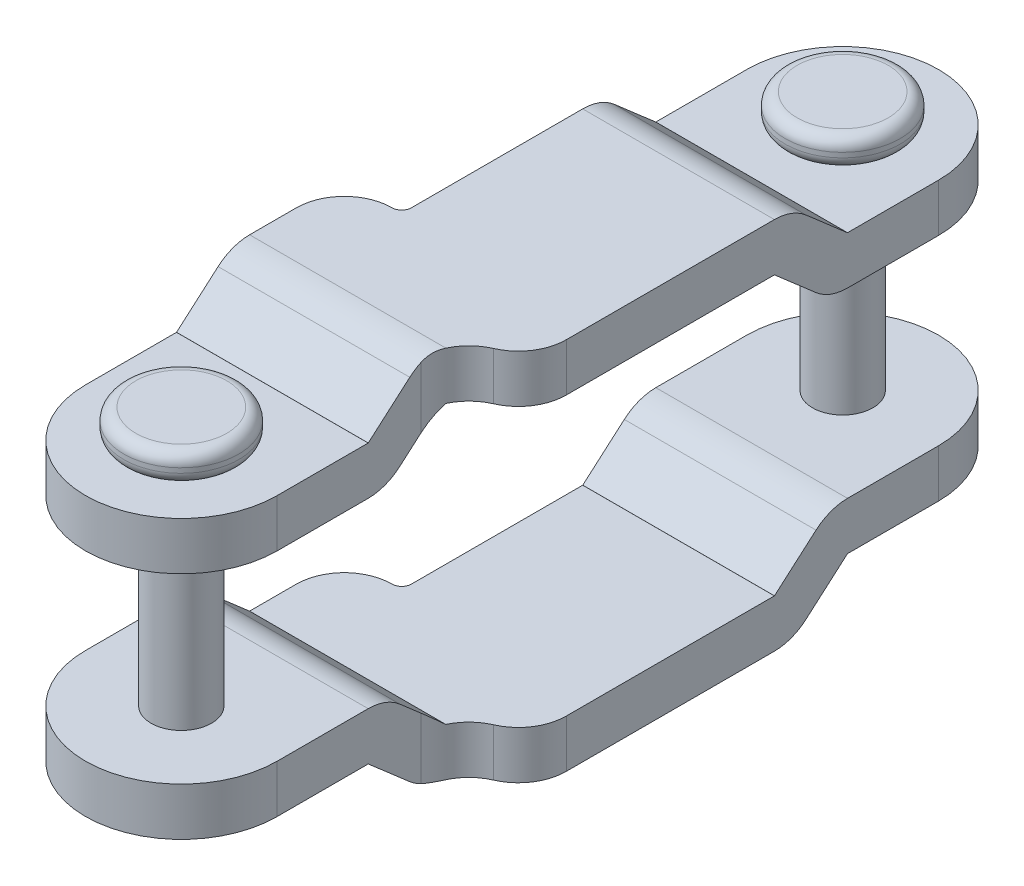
ISO-10303-21;
HEADER;
FILE_DESCRIPTION(('STEP AP214'),'2;1');
FILE_NAME('part.step','',(''),(''),'','','');
FILE_SCHEMA(('AUTOMOTIVE_DESIGN { 1 0 10303 214 1 1 1 1 }'));
ENDSEC;
DATA;
#1=APPLICATION_CONTEXT('core data for automotive mechanical design processes');
#2=APPLICATION_PROTOCOL_DEFINITION('international standard','automotive_design',2000,#1);
#3=PRODUCT_CONTEXT('',#1,'mechanical');
#4=PRODUCT('Part','Part','',(#3));
#5=PRODUCT_RELATED_PRODUCT_CATEGORY('part','',(#4));
#6=PRODUCT_DEFINITION_FORMATION('','',#4);
#7=PRODUCT_DEFINITION_CONTEXT('part definition',#1,'design');
#8=PRODUCT_DEFINITION('design','',#6,#7);
#9=PRODUCT_DEFINITION_SHAPE('','',#8);
#10=(LENGTH_UNIT() NAMED_UNIT(*) SI_UNIT(.MILLI.,.METRE.));
#11=(NAMED_UNIT(*) PLANE_ANGLE_UNIT() SI_UNIT($,.RADIAN.));
#12=(NAMED_UNIT(*) SI_UNIT($,.STERADIAN.) SOLID_ANGLE_UNIT());
#13=UNCERTAINTY_MEASURE_WITH_UNIT(LENGTH_MEASURE(1.E-05),#10,'distance_accuracy_value','');
#14=(GEOMETRIC_REPRESENTATION_CONTEXT(3) GLOBAL_UNCERTAINTY_ASSIGNED_CONTEXT((#13)) GLOBAL_UNIT_ASSIGNED_CONTEXT((#10,
#11,#12)) REPRESENTATION_CONTEXT('',''));
#15=CARTESIAN_POINT('',(0.,0.,0.));
#16=DIRECTION('',(0.,0.,1.));
#17=DIRECTION('',(1.,0.,0.));
#18=AXIS2_PLACEMENT_3D('',#15,#16,#17);
#19=CARTESIAN_POINT('',(-6.00000000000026,17.5,63.));
#20=DIRECTION('',(0.,-1.,0.));
#21=DIRECTION('',(0.985391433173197,0.,-0.170304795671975));
#22=AXIS2_PLACEMENT_3D('',#19,#20,#21);
#23=PLANE('',#22);
#24=CARTESIAN_POINT('',(-6.00000000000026,17.5,63.));
#25=DIRECTION('',(0.,1.,0.));
#26=DIRECTION('',(0.985391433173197,0.,-0.170304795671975));
#27=AXIS2_PLACEMENT_3D('',#24,#25,#26);
#28=CIRCLE('',#27,4.75);
#29=CARTESIAN_POINT('',(-1.31939069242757,17.5,62.1910522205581));
#30=VERTEX_POINT('',#29);
#31=EDGE_CURVE('E2212',#30,#30,#28,.T.);
#32=ORIENTED_EDGE('',*,*,#31,.T.);
#33=EDGE_LOOP('',(#32));
#34=FACE_BOUND('',#33,.T.);
#35=ADVANCED_FACE('F14',(#34),#23,.F.);
#36=CARTESIAN_POINT('',(-6.00000000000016,16.25,63.));
#37=DIRECTION('',(0.,-1.,0.));
#38=DIRECTION('',(0.985391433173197,0.,-0.170304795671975));
#39=AXIS2_PLACEMENT_3D('',#36,#37,#38);
#40=TOROIDAL_SURFACE('',#39,4.75,1.25);
#41=CARTESIAN_POINT('',(-6.00000000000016,16.25,63.));
#42=DIRECTION('',(0.,-1.,0.));
#43=DIRECTION('',(0.985391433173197,0.,-0.170304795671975));
#44=AXIS2_PLACEMENT_3D('',#41,#42,#43);
#45=CIRCLE('',#44,6.);
#46=CARTESIAN_POINT('',(-0.0876514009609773,16.25,61.9781712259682));
#47=VERTEX_POINT('',#46);
#48=EDGE_CURVE('E2235',#47,#47,#45,.T.);
#49=ORIENTED_EDGE('',*,*,#48,.F.);
#50=EDGE_LOOP('',(#49));
#51=FACE_BOUND('',#50,.T.);
#52=ORIENTED_EDGE('',*,*,#31,.F.);
#53=EDGE_LOOP('',(#52));
#54=FACE_BOUND('',#53,.T.);
#55=ADVANCED_FACE('F1585',(#51,#54),#40,.T.);
#56=CARTESIAN_POINT('',(-6.00000000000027,14.5000000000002,63.));
#57=DIRECTION('',(0.,1.,0.));
#58=DIRECTION('',(-0.985391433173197,0.,0.170304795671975));
#59=AXIS2_PLACEMENT_3D('',#56,#57,#58);
#60=CYLINDRICAL_SURFACE('',#59,6.);
#61=ORIENTED_EDGE('',*,*,#48,.T.);
#62=EDGE_LOOP('',(#61));
#63=FACE_BOUND('',#62,.T.);
#64=CARTESIAN_POINT('',(-6.00000000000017,15.7500000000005,63.));
#65=DIRECTION('',(0.,1.,0.));
#66=DIRECTION('',(0.985391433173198,0.,-0.170304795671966));
#67=AXIS2_PLACEMENT_3D('',#64,#65,#66);
#68=CIRCLE('',#67,6.);
#69=CARTESIAN_POINT('',(-0.0876514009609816,15.7500000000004,61.9781712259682));
#70=VERTEX_POINT('',#69);
#71=EDGE_CURVE('E2228',#70,#70,#68,.T.);
#72=ORIENTED_EDGE('',*,*,#71,.T.);
#73=EDGE_LOOP('',(#72));
#74=FACE_BOUND('',#73,.T.);
#75=ADVANCED_FACE('F1574',(#63,#74),#60,.T.);
#76=CARTESIAN_POINT('',(-6.00000000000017,15.7500000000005,63.));
#77=DIRECTION('',(0.,-1.,0.));
#78=DIRECTION('',(0.985391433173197,0.,-0.170304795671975));
#79=AXIS2_PLACEMENT_3D('',#76,#77,#78);
#80=TOROIDAL_SURFACE('',#79,4.75,1.25);
#81=CARTESIAN_POINT('',(-6.00000000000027,14.5000000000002,63.));
#82=DIRECTION('',(0.,-1.,0.));
#83=DIRECTION('',(0.985391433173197,0.,-0.170304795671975));
#84=AXIS2_PLACEMENT_3D('',#81,#82,#83);
#85=CIRCLE('',#84,4.75);
#86=CARTESIAN_POINT('',(-1.31939069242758,14.5000000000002,62.1910522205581));
#87=VERTEX_POINT('',#86);
#88=EDGE_CURVE('E2216',#87,#87,#85,.T.);
#89=ORIENTED_EDGE('',*,*,#88,.F.);
#90=EDGE_LOOP('',(#89));
#91=FACE_BOUND('',#90,.T.);
#92=ORIENTED_EDGE('',*,*,#71,.F.);
#93=EDGE_LOOP('',(#92));
#94=FACE_BOUND('',#93,.T.);
#95=ADVANCED_FACE('F842',(#91,#94),#80,.T.);
#96=CARTESIAN_POINT('',(-6.00000000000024,-17.4999999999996,63.));
#97=DIRECTION('',(0.,-1.,0.));
#98=DIRECTION('',(0.985391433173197,0.,-0.170304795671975));
#99=AXIS2_PLACEMENT_3D('',#96,#97,#98);
#100=PLANE('',#99);
#101=CARTESIAN_POINT('',(-6.00000000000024,-17.4999999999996,63.));
#102=DIRECTION('',(0.,-1.,0.));
#103=DIRECTION('',(0.985391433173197,0.,-0.170304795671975));
#104=AXIS2_PLACEMENT_3D('',#101,#102,#103);
#105=CIRCLE('',#104,4.75);
#106=CARTESIAN_POINT('',(-1.31939069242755,-17.4999999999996,62.1910522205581));
#107=VERTEX_POINT('',#106);
#108=EDGE_CURVE('E2206',#107,#107,#105,.T.);
#109=ORIENTED_EDGE('',*,*,#108,.T.);
#110=EDGE_LOOP('',(#109));
#111=FACE_BOUND('',#110,.T.);
#112=ADVANCED_FACE('F1438',(#111),#100,.T.);
#113=CARTESIAN_POINT('',(-6.00000000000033,-16.25,63.));
#114=DIRECTION('',(0.,-1.,0.));
#115=DIRECTION('',(0.985391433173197,0.,-0.170304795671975));
#116=AXIS2_PLACEMENT_3D('',#113,#114,#115);
#117=TOROIDAL_SURFACE('',#116,4.75,1.25);
#118=ORIENTED_EDGE('',*,*,#108,.F.);
#119=EDGE_LOOP('',(#118));
#120=FACE_BOUND('',#119,.T.);
#121=CARTESIAN_POINT('',(-6.00000000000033,-16.25,63.));
#122=DIRECTION('',(0.,1.,0.));
#123=DIRECTION('',(0.985391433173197,0.,-0.170304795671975));
#124=AXIS2_PLACEMENT_3D('',#121,#122,#123);
#125=CIRCLE('',#124,6.);
#126=CARTESIAN_POINT('',(-0.0876514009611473,-16.25,61.9781712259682));
#127=VERTEX_POINT('',#126);
#128=EDGE_CURVE('E2221',#127,#127,#125,.T.);
#129=ORIENTED_EDGE('',*,*,#128,.F.);
#130=EDGE_LOOP('',(#129));
#131=FACE_BOUND('',#130,.T.);
#132=ADVANCED_FACE('F1543',(#120,#131),#117,.T.);
#133=CARTESIAN_POINT('',(-6.00000000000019,-14.4999999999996,63.));
#134=DIRECTION('',(0.,-1.,0.));
#135=DIRECTION('',(0.985391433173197,0.,-0.170304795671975));
#136=AXIS2_PLACEMENT_3D('',#133,#134,#135);
#137=CYLINDRICAL_SURFACE('',#136,6.);
#138=ORIENTED_EDGE('',*,*,#128,.T.);
#139=EDGE_LOOP('',(#138));
#140=FACE_BOUND('',#139,.T.);
#141=CARTESIAN_POINT('',(-6.00000000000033,-15.75,63.));
#142=DIRECTION('',(0.,-1.,0.));
#143=DIRECTION('',(-0.985391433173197,0.,0.170304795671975));
#144=AXIS2_PLACEMENT_3D('',#141,#142,#143);
#145=CIRCLE('',#144,6.);
#146=CARTESIAN_POINT('',(-11.9123485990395,-15.75,64.0218287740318));
#147=VERTEX_POINT('',#146);
#148=EDGE_CURVE('E2211',#147,#147,#145,.T.);
#149=ORIENTED_EDGE('',*,*,#148,.T.);
#150=EDGE_LOOP('',(#149));
#151=FACE_BOUND('',#150,.T.);
#152=ADVANCED_FACE('F1531',(#140,#151),#137,.T.);
#153=CARTESIAN_POINT('',(-6.00000000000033,-15.75,63.));
#154=DIRECTION('',(0.,1.,0.));
#155=DIRECTION('',(-0.985391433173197,0.,0.170304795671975));
#156=AXIS2_PLACEMENT_3D('',#153,#154,#155);
#157=TOROIDAL_SURFACE('',#156,4.75,1.25);
#158=CARTESIAN_POINT('',(-6.00000000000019,-14.4999999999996,63.));
#159=DIRECTION('',(0.,1.,0.));
#160=DIRECTION('',(-0.985391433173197,0.,0.170304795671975));
#161=AXIS2_PLACEMENT_3D('',#158,#159,#160);
#162=CIRCLE('',#161,4.75);
#163=CARTESIAN_POINT('',(-10.6806093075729,-14.4999999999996,63.8089477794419));
#164=VERTEX_POINT('',#163);
#165=EDGE_CURVE('E2217',#164,#164,#162,.T.);
#166=ORIENTED_EDGE('',*,*,#165,.F.);
#167=EDGE_LOOP('',(#166));
#168=FACE_BOUND('',#167,.T.);
#169=ORIENTED_EDGE('',*,*,#148,.F.);
#170=EDGE_LOOP('',(#169));
#171=FACE_BOUND('',#170,.T.);
#172=ADVANCED_FACE('F839',(#168,#171),#157,.T.);
#173=CARTESIAN_POINT('',(-6.00000000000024,-17.4999999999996,63.));
#174=DIRECTION('',(0.,1.,0.));
#175=DIRECTION('',(-0.985391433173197,0.,0.170304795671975));
#176=AXIS2_PLACEMENT_3D('',#173,#174,#175);
#177=CYLINDRICAL_SURFACE('',#176,3.15);
#178=CARTESIAN_POINT('',(-6.00000000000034,9.50000000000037,63.));
#179=DIRECTION('',(0.,-1.,0.));
#180=DIRECTION('',(0.9811100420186,0.,-0.193450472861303));
#181=AXIS2_PLACEMENT_3D('',#178,#179,#180);
#182=CIRCLE('',#181,3.15);
#183=CARTESIAN_POINT('',(-2.90950336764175,9.50000000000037,62.3906310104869));
#184=VERTEX_POINT('',#183);
#185=EDGE_CURVE('E9',#184,#184,#182,.F.);
#186=ORIENTED_EDGE('',*,*,#185,.F.);
#187=EDGE_LOOP('',(#186));
#188=FACE_BOUND('',#187,.T.);
#189=CARTESIAN_POINT('',(-6.00000000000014,-9.49999999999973,63.));
#190=DIRECTION('',(0.,1.,0.));
#191=DIRECTION('',(-0.9811100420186,0.,0.193450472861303));
#192=AXIS2_PLACEMENT_3D('',#189,#190,#191);
#193=CIRCLE('',#192,3.15);
#194=CARTESIAN_POINT('',(-9.09049663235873,-9.49999999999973,63.6093689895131));
#195=VERTEX_POINT('',#194);
#196=EDGE_CURVE('E24',#195,#195,#193,.F.);
#197=ORIENTED_EDGE('',*,*,#196,.F.);
#198=EDGE_LOOP('',(#197));
#199=FACE_BOUND('',#198,.T.);
#200=ADVANCED_FACE('F828',(#188,#199),#177,.T.);
#201=CARTESIAN_POINT('',(0.,17.5000000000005,0.));
#202=DIRECTION('',(0.,-1.,0.));
#203=DIRECTION('',(0.985391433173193,0.,-0.170304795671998));
#204=AXIS2_PLACEMENT_3D('',#201,#202,#203);
#205=PLANE('',#204);
#206=CARTESIAN_POINT('',(0.,17.5000000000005,0.));
#207=DIRECTION('',(0.,1.,0.));
#208=DIRECTION('',(0.985391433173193,0.,-0.170304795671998));
#209=AXIS2_PLACEMENT_3D('',#206,#207,#208);
#210=CIRCLE('',#209,4.75);
#211=CARTESIAN_POINT('',(4.68060930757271,17.5000000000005,-0.808947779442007));
#212=VERTEX_POINT('',#211);
#213=EDGE_CURVE('E1828',#212,#212,#210,.T.);
#214=ORIENTED_EDGE('',*,*,#213,.T.);
#215=EDGE_LOOP('',(#214));
#216=FACE_BOUND('',#215,.T.);
#217=ADVANCED_FACE('F825',(#216),#205,.F.);
#218=CARTESIAN_POINT('',(0.,-17.4999999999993,0.));
#219=DIRECTION('',(0.,-1.,0.));
#220=DIRECTION('',(0.985391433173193,0.,-0.170304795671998));
#221=AXIS2_PLACEMENT_3D('',#218,#219,#220);
#222=PLANE('',#221);
#223=CARTESIAN_POINT('',(0.,-17.4999999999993,0.));
#224=DIRECTION('',(0.,-1.,0.));
#225=DIRECTION('',(0.985391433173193,0.,-0.170304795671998));
#226=AXIS2_PLACEMENT_3D('',#223,#224,#225);
#227=CIRCLE('',#226,4.75);
#228=CARTESIAN_POINT('',(4.68060930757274,-17.4999999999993,-0.808947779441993));
#229=VERTEX_POINT('',#228);
#230=EDGE_CURVE('E1837',#229,#229,#227,.T.);
#231=ORIENTED_EDGE('',*,*,#230,.T.);
#232=EDGE_LOOP('',(#231));
#233=FACE_BOUND('',#232,.T.);
#234=ADVANCED_FACE('F827',(#233),#222,.T.);
#235=CARTESIAN_POINT('',(0.,16.2500000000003,0.));
#236=DIRECTION('',(0.,-1.,0.));
#237=DIRECTION('',(0.985391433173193,0.,-0.170304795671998));
#238=AXIS2_PLACEMENT_3D('',#235,#236,#237);
#239=TOROIDAL_SURFACE('',#238,4.75,1.25);
#240=CARTESIAN_POINT('',(0.,16.2500000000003,0.));
#241=DIRECTION('',(0.,-1.,0.));
#242=DIRECTION('',(0.985391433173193,0.,-0.170304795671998));
#243=AXIS2_PLACEMENT_3D('',#240,#241,#242);
#244=CIRCLE('',#243,6.);
#245=CARTESIAN_POINT('',(5.91234859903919,16.2500000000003,-1.02182877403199));
#246=VERTEX_POINT('',#245);
#247=EDGE_CURVE('E1818',#246,#246,#244,.T.);
#248=ORIENTED_EDGE('',*,*,#247,.F.);
#249=EDGE_LOOP('',(#248));
#250=FACE_BOUND('',#249,.T.);
#251=ORIENTED_EDGE('',*,*,#213,.F.);
#252=EDGE_LOOP('',(#251));
#253=FACE_BOUND('',#252,.T.);
#254=ADVANCED_FACE('F836',(#250,#253),#239,.T.);
#255=CARTESIAN_POINT('',(0.,-16.2499999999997,0.));
#256=DIRECTION('',(0.,-1.,0.));
#257=DIRECTION('',(0.985391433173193,0.,-0.170304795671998));
#258=AXIS2_PLACEMENT_3D('',#255,#256,#257);
#259=TOROIDAL_SURFACE('',#258,4.75,1.25);
#260=ORIENTED_EDGE('',*,*,#230,.F.);
#261=EDGE_LOOP('',(#260));
#262=FACE_BOUND('',#261,.T.);
#263=CARTESIAN_POINT('',(0.,-16.2499999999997,0.));
#264=DIRECTION('',(0.,1.,0.));
#265=DIRECTION('',(0.985391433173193,0.,-0.170304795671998));
#266=AXIS2_PLACEMENT_3D('',#263,#264,#265);
#267=CIRCLE('',#266,6.);
#268=CARTESIAN_POINT('',(5.91234859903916,-16.2499999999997,-1.02182877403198));
#269=VERTEX_POINT('',#268);
#270=EDGE_CURVE('E1808',#269,#269,#267,.T.);
#271=ORIENTED_EDGE('',*,*,#270,.F.);
#272=EDGE_LOOP('',(#271));
#273=FACE_BOUND('',#272,.T.);
#274=ADVANCED_FACE('F846',(#262,#273),#259,.T.);
#275=CARTESIAN_POINT('',(0.,14.5000000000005,0.));
#276=DIRECTION('',(0.,1.,0.));
#277=DIRECTION('',(-0.985391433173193,0.,0.170304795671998));
#278=AXIS2_PLACEMENT_3D('',#275,#276,#277);
#279=CYLINDRICAL_SURFACE('',#278,6.);
#280=ORIENTED_EDGE('',*,*,#247,.T.);
#281=EDGE_LOOP('',(#280));
#282=FACE_BOUND('',#281,.T.);
#283=CARTESIAN_POINT('',(0.,15.7500000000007,0.));
#284=DIRECTION('',(0.,1.,0.));
#285=DIRECTION('',(0.985391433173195,0.,-0.17030479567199));
#286=AXIS2_PLACEMENT_3D('',#283,#284,#285);
#287=CIRCLE('',#286,6.);
#288=CARTESIAN_POINT('',(5.9123485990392,15.7500000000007,-1.0218287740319));
#289=VERTEX_POINT('',#288);
#290=EDGE_CURVE('E1813',#289,#289,#287,.T.);
#291=ORIENTED_EDGE('',*,*,#290,.T.);
#292=EDGE_LOOP('',(#291));
#293=FACE_BOUND('',#292,.T.);
#294=ADVANCED_FACE('F1500',(#282,#293),#279,.T.);
#295=CARTESIAN_POINT('',(0.,-14.4999999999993,0.));
#296=DIRECTION('',(0.,-1.,0.));
#297=DIRECTION('',(0.985391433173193,0.,-0.170304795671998));
#298=AXIS2_PLACEMENT_3D('',#295,#296,#297);
#299=CYLINDRICAL_SURFACE('',#298,6.);
#300=ORIENTED_EDGE('',*,*,#270,.T.);
#301=EDGE_LOOP('',(#300));
#302=FACE_BOUND('',#301,.T.);
#303=CARTESIAN_POINT('',(0.,-15.7499999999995,0.));
#304=DIRECTION('',(0.,-1.,0.));
#305=DIRECTION('',(-0.985391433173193,0.,0.170304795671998));
#306=AXIS2_PLACEMENT_3D('',#303,#304,#305);
#307=CIRCLE('',#306,6.);
#308=CARTESIAN_POINT('',(-5.91234859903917,-15.7499999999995,1.02182877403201));
#309=VERTEX_POINT('',#308);
#310=EDGE_CURVE('E1803',#309,#309,#307,.T.);
#311=ORIENTED_EDGE('',*,*,#310,.T.);
#312=EDGE_LOOP('',(#311));
#313=FACE_BOUND('',#312,.T.);
#314=ADVANCED_FACE('F1488',(#302,#313),#299,.T.);
#315=CARTESIAN_POINT('',(0.,-17.4999999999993,0.));
#316=DIRECTION('',(0.,1.,0.));
#317=DIRECTION('',(-0.985391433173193,0.,0.170304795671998));
#318=AXIS2_PLACEMENT_3D('',#315,#316,#317);
#319=CYLINDRICAL_SURFACE('',#318,3.15);
#320=CARTESIAN_POINT('',(0.,9.50000000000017,0.));
#321=DIRECTION('',(0.,-1.,0.));
#322=DIRECTION('',(0.9811100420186,0.,-0.193450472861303));
#323=AXIS2_PLACEMENT_3D('',#320,#321,#322);
#324=CIRCLE('',#323,3.15);
#325=CARTESIAN_POINT('',(3.09049663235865,9.50000000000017,-0.609368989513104));
#326=VERTEX_POINT('',#325);
#327=EDGE_CURVE('E2200',#326,#326,#324,.F.);
#328=ORIENTED_EDGE('',*,*,#327,.F.);
#329=EDGE_LOOP('',(#328));
#330=FACE_BOUND('',#329,.T.);
#331=CARTESIAN_POINT('',(0.,-9.5,0.));
#332=DIRECTION('',(0.,1.,0.));
#333=DIRECTION('',(-0.9811100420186,0.,0.193450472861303));
#334=AXIS2_PLACEMENT_3D('',#331,#332,#333);
#335=CIRCLE('',#334,3.15);
#336=CARTESIAN_POINT('',(-3.09049663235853,-9.5,0.609368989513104));
#337=VERTEX_POINT('',#336);
#338=EDGE_CURVE('E1807',#337,#337,#335,.F.);
#339=ORIENTED_EDGE('',*,*,#338,.F.);
#340=EDGE_LOOP('',(#339));
#341=FACE_BOUND('',#340,.T.);
#342=ADVANCED_FACE('F850',(#330,#341),#319,.T.);
#343=CARTESIAN_POINT('',(0.,-15.7499999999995,0.));
#344=DIRECTION('',(0.,1.,0.));
#345=DIRECTION('',(-0.985391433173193,0.,0.170304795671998));
#346=AXIS2_PLACEMENT_3D('',#343,#344,#345);
#347=TOROIDAL_SURFACE('',#346,4.75,1.25);
#348=CARTESIAN_POINT('',(0.,-14.4999999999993,0.));
#349=DIRECTION('',(0.,1.,0.));
#350=DIRECTION('',(-0.985391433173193,0.,0.170304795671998));
#351=AXIS2_PLACEMENT_3D('',#348,#349,#350);
#352=CIRCLE('',#351,4.75);
#353=CARTESIAN_POINT('',(-4.68060930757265,-14.4999999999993,0.808947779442));
#354=VERTEX_POINT('',#353);
#355=EDGE_CURVE('E1832',#354,#354,#352,.T.);
#356=ORIENTED_EDGE('',*,*,#355,.F.);
#357=EDGE_LOOP('',(#356));
#358=FACE_BOUND('',#357,.T.);
#359=ORIENTED_EDGE('',*,*,#310,.F.);
#360=EDGE_LOOP('',(#359));
#361=FACE_BOUND('',#360,.T.);
#362=ADVANCED_FACE('F546',(#358,#361),#347,.T.);
#363=CARTESIAN_POINT('',(-3.05311331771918E-13,-14.5099999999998,0.));
#364=DIRECTION('',(0.,-1.,0.));
#365=DIRECTION('',(1.,0.,0.));
#366=AXIS2_PLACEMENT_3D('',#363,#364,#365);
#367=CYLINDRICAL_SURFACE('',#366,10.);
#368=DIRECTION('',(0.,1.,0.));
#369=VECTOR('',#368,1.);
#370=CARTESIAN_POINT('',(9.99999999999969,-9.5,0.));
#371=LINE('',#370,#369);
#372=CARTESIAN_POINT('',(9.99999999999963,-14.4999999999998,0.));
#373=VERTEX_POINT('',#372);
#374=CARTESIAN_POINT('',(9.99999999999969,-9.5,0.));
#375=VERTEX_POINT('',#374);
#376=EDGE_CURVE('E502',#373,#375,#371,.T.);
#377=ORIENTED_EDGE('',*,*,#376,.F.);
#378=CARTESIAN_POINT('',(-3.74700270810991E-13,-14.4999999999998,0.));
#379=DIRECTION('',(0.,-1.,0.));
#380=DIRECTION('',(-1.,0.,0.));
#381=AXIS2_PLACEMENT_3D('',#378,#379,#380);
#382=CIRCLE('',#381,10.);
#383=CARTESIAN_POINT('',(-10.0000000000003,-14.4999999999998,1.04083408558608E-13));
#384=VERTEX_POINT('',#383);
#385=EDGE_CURVE('E411',#384,#373,#382,.T.);
#386=ORIENTED_EDGE('',*,*,#385,.F.);
#387=DIRECTION('',(0.,-1.,0.));
#388=VECTOR('',#387,1.);
#389=CARTESIAN_POINT('',(-10.0000000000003,-14.4999999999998,1.04083408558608E-13));
#390=LINE('',#389,#388);
#391=CARTESIAN_POINT('',(-10.0000000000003,-9.5,0.));
#392=VERTEX_POINT('',#391);
#393=EDGE_CURVE('E371',#392,#384,#390,.T.);
#394=ORIENTED_EDGE('',*,*,#393,.F.);
#395=CARTESIAN_POINT('',(-3.33066907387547E-13,-9.5,0.));
#396=DIRECTION('',(0.,1.,0.));
#397=DIRECTION('',(-1.,0.,0.));
#398=AXIS2_PLACEMENT_3D('',#395,#396,#397);
#399=CIRCLE('',#398,10.);
#400=EDGE_CURVE('E380',#375,#392,#399,.T.);
#401=ORIENTED_EDGE('',*,*,#400,.F.);
#402=EDGE_LOOP('',(#377,#386,#394,#401));
#403=FACE_BOUND('',#402,.T.);
#404=ADVANCED_FACE('F542',(#403),#367,.T.);
#405=CARTESIAN_POINT('',(-16.0000000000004,-9.5,-10.));
#406=DIRECTION('',(0.,1.,0.));
#407=DIRECTION('',(0.,0.,1.));
#408=AXIS2_PLACEMENT_3D('',#405,#406,#407);
#409=PLANE('',#408);
#410=ORIENTED_EDGE('',*,*,#400,.T.);
#411=DIRECTION('',(0.,0.,-1.));
#412=VECTOR('',#411,1.);
#413=CARTESIAN_POINT('',(-10.0000000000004,-9.5,-9.99999999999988));
#414=LINE('',#413,#412);
#415=CARTESIAN_POINT('',(-10.0000000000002,-9.49999999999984,9.49626024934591));
#416=VERTEX_POINT('',#415);
#417=EDGE_CURVE('E375',#416,#392,#414,.T.);
#418=ORIENTED_EDGE('',*,*,#417,.F.);
#419=DIRECTION('',(1.,0.,0.));
#420=VECTOR('',#419,1.);
#421=CARTESIAN_POINT('',(-16.,-9.5,9.49626024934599));
#422=LINE('',#421,#420);
#423=CARTESIAN_POINT('',(9.99999999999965,-9.49999999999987,9.49626024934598));
#424=VERTEX_POINT('',#423);
#425=EDGE_CURVE('E384',#416,#424,#422,.T.);
#426=ORIENTED_EDGE('',*,*,#425,.T.);
#427=DIRECTION('',(0.,0.,1.));
#428=VECTOR('',#427,1.);
#429=CARTESIAN_POINT('',(9.99999999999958,-9.5,-10.));
#430=LINE('',#429,#428);
#431=EDGE_CURVE('E592',#375,#424,#430,.T.);
#432=ORIENTED_EDGE('',*,*,#431,.F.);
#433=EDGE_LOOP('',(#410,#418,#426,#432));
#434=FACE_BOUND('',#433,.T.);
#435=ORIENTED_EDGE('',*,*,#338,.T.);
#436=EDGE_LOOP('',(#435));
#437=FACE_BOUND('',#436,.T.);
#438=ADVANCED_FACE('F545',(#434,#437),#409,.T.);
#439=CARTESIAN_POINT('',(-16.0000000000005,-14.5,-9.99999999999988));
#440=DIRECTION('',(0.,1.,0.));
#441=DIRECTION('',(0.,0.,1.));
#442=AXIS2_PLACEMENT_3D('',#439,#440,#441);
#443=PLANE('',#442);
#444=DIRECTION('',(0.,0.,-1.));
#445=VECTOR('',#444,1.);
#446=CARTESIAN_POINT('',(-10.0000000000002,-14.4999999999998,-10.));
#447=LINE('',#446,#445);
#448=CARTESIAN_POINT('',(-10.0000000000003,-14.4999999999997,9.49626024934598));
#449=VERTEX_POINT('',#448);
#450=EDGE_CURVE('E407',#449,#384,#447,.T.);
#451=ORIENTED_EDGE('',*,*,#450,.T.);
#452=ORIENTED_EDGE('',*,*,#385,.T.);
#453=DIRECTION('',(0.,0.,1.));
#454=VECTOR('',#453,1.);
#455=CARTESIAN_POINT('',(9.99999999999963,-14.4999999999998,-10.));
#456=LINE('',#455,#454);
#457=CARTESIAN_POINT('',(9.99999999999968,-14.4999999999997,9.49626024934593));
#458=VERTEX_POINT('',#457);
#459=EDGE_CURVE('E491',#373,#458,#456,.T.);
#460=ORIENTED_EDGE('',*,*,#459,.T.);
#461=DIRECTION('',(1.,0.,0.));
#462=VECTOR('',#461,1.);
#463=CARTESIAN_POINT('',(-16.0000000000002,-14.4999999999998,9.496260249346));
#464=LINE('',#463,#462);
#465=EDGE_CURVE('E340',#449,#458,#464,.T.);
#466=ORIENTED_EDGE('',*,*,#465,.F.);
#467=EDGE_LOOP('',(#451,#452,#460,#466));
#468=FACE_BOUND('',#467,.T.);
#469=ORIENTED_EDGE('',*,*,#355,.T.);
#470=EDGE_LOOP('',(#469));
#471=FACE_BOUND('',#470,.T.);
#472=ADVANCED_FACE('F706',(#468,#471),#443,.F.);
#473=CARTESIAN_POINT('',(-16.0000000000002,-14.5099999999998,9.49626024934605));
#474=DIRECTION('',(1.,0.,0.));
#475=DIRECTION('',(0.,0.,-1.));
#476=AXIS2_PLACEMENT_3D('',#473,#474,#475);
#477=CYLINDRICAL_SURFACE('',#476,5.01);
#478=ORIENTED_EDGE('',*,*,#425,.F.);
#479=CARTESIAN_POINT('',(-10.0000000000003,-14.5099999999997,9.49626024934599));
#480=DIRECTION('',(-1.,0.,0.));
#481=DIRECTION('',(0.,0.,-1.));
#482=AXIS2_PLACEMENT_3D('',#479,#480,#481);
#483=CIRCLE('',#482,5.01);
#484=CARTESIAN_POINT('',(-10.0000000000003,-10.7294263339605,12.783715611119));
#485=VERTEX_POINT('',#484);
#486=EDGE_CURVE('E294',#485,#416,#483,.T.);
#487=ORIENTED_EDGE('',*,*,#486,.F.);
#488=DIRECTION('',(1.,0.,0.));
#489=VECTOR('',#488,1.);
#490=CARTESIAN_POINT('',(-16.,-10.7294263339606,12.7837156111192));
#491=LINE('',#490,#489);
#492=CARTESIAN_POINT('',(9.9999999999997,-10.729426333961,12.7837156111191));
#493=VERTEX_POINT('',#492);
#494=EDGE_CURVE('E376',#485,#493,#491,.T.);
#495=ORIENTED_EDGE('',*,*,#494,.T.);
#496=CARTESIAN_POINT('',(9.99999999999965,-14.5099999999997,9.49626024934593));
#497=DIRECTION('',(1.,0.,0.));
#498=DIRECTION('',(0.,0.,1.));
#499=AXIS2_PLACEMENT_3D('',#496,#497,#498);
#500=CIRCLE('',#499,5.01);
#501=EDGE_CURVE('E319',#424,#493,#500,.T.);
#502=ORIENTED_EDGE('',*,*,#501,.F.);
#503=EDGE_LOOP('',(#478,#487,#495,#502));
#504=FACE_BOUND('',#503,.T.);
#505=ADVANCED_FACE('F734',(#504),#477,.T.);
#506=CARTESIAN_POINT('',(-16.0000000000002,-14.5099999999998,9.49626024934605));
#507=DIRECTION('',(1.,0.,0.));
#508=DIRECTION('',(0.,0.,-1.));
#509=AXIS2_PLACEMENT_3D('',#506,#507,#508);
#510=CYLINDRICAL_SURFACE('',#509,0.00999999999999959);
#511=CARTESIAN_POINT('',(-10.0000000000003,-14.5099999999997,9.49626024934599));
#512=DIRECTION('',(-1.,0.,0.));
#513=DIRECTION('',(0.,6.03995526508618E-13,-1.));
#514=AXIS2_PLACEMENT_3D('',#511,#512,#513);
#515=CIRCLE('',#514,0.00999999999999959);
#516=CARTESIAN_POINT('',(-10.0000000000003,-14.5024539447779,9.50282203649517));
#517=VERTEX_POINT('',#516);
#518=EDGE_CURVE('E443',#517,#449,#515,.T.);
#519=ORIENTED_EDGE('',*,*,#518,.T.);
#520=ORIENTED_EDGE('',*,*,#465,.T.);
#521=CARTESIAN_POINT('',(9.99999999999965,-14.5099999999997,9.49626024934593));
#522=DIRECTION('',(1.,0.,0.));
#523=DIRECTION('',(0.,-7.64762380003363E-13,1.));
#524=AXIS2_PLACEMENT_3D('',#521,#522,#523);
#525=CIRCLE('',#524,0.00999999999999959);
#526=CARTESIAN_POINT('',(9.99999999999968,-14.5024539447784,9.50282203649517));
#527=VERTEX_POINT('',#526);
#528=EDGE_CURVE('E333',#458,#527,#525,.T.);
#529=ORIENTED_EDGE('',*,*,#528,.T.);
#530=DIRECTION('',(1.,0.,0.));
#531=VECTOR('',#530,1.);
#532=CARTESIAN_POINT('',(-16.0000000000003,-14.502453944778,9.50282203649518));
#533=LINE('',#532,#531);
#534=EDGE_CURVE('E434',#517,#527,#533,.T.);
#535=ORIENTED_EDGE('',*,*,#534,.F.);
#536=EDGE_LOOP('',(#519,#520,#529,#535));
#537=FACE_BOUND('',#536,.T.);
#538=ADVANCED_FACE('F535',(#537),#510,.F.);
#539=CARTESIAN_POINT('',(-16.0000000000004,-10.7269723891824,12.7808935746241));
#540=DIRECTION('',(0.,0.754605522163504,0.656178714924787));
#541=DIRECTION('',(1.,0.,0.));
#542=AXIS2_PLACEMENT_3D('',#539,#540,#541);
#543=PLANE('',#542);
#544=ORIENTED_EDGE('',*,*,#494,.F.);
#545=DIRECTION('',(0.,0.656178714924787,-0.754605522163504));
#546=VECTOR('',#545,1.);
#547=CARTESIAN_POINT('',(-10.0000000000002,-10.7269723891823,12.780893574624));
#548=LINE('',#547,#546);
#549=CARTESIAN_POINT('',(-10.0000000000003,-14.4975460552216,17.117053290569));
#550=VERTEX_POINT('',#549);
#551=EDGE_CURVE('E350',#550,#485,#548,.T.);
#552=ORIENTED_EDGE('',*,*,#551,.F.);
#553=DIRECTION('',(1.,0.,0.));
#554=VECTOR('',#553,1.);
#555=CARTESIAN_POINT('',(-16.0000000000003,-14.4975460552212,17.117053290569));
#556=LINE('',#555,#554);
#557=CARTESIAN_POINT('',(9.99999999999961,-14.4975460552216,17.117053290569));
#558=VERTEX_POINT('',#557);
#559=EDGE_CURVE('E379',#550,#558,#556,.T.);
#560=ORIENTED_EDGE('',*,*,#559,.T.);
#561=DIRECTION('',(0.,-0.656178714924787,0.754605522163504));
#562=VECTOR('',#561,1.);
#563=CARTESIAN_POINT('',(9.99999999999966,-10.7269723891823,12.7808935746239));
#564=LINE('',#563,#562);
#565=EDGE_CURVE('E324',#493,#558,#564,.T.);
#566=ORIENTED_EDGE('',*,*,#565,.F.);
#567=EDGE_LOOP('',(#544,#552,#560,#566));
#568=FACE_BOUND('',#567,.T.);
#569=ADVANCED_FACE('F537',(#568),#543,.T.);
#570=CARTESIAN_POINT('',(-16.0000000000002,-14.4999999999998,9.5));
#571=DIRECTION('',(0.,0.754605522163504,0.656178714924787));
#572=DIRECTION('',(1.,0.,0.));
#573=AXIS2_PLACEMENT_3D('',#570,#571,#572);
#574=PLANE('',#573);
#575=DIRECTION('',(0.,0.656178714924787,-0.754605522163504));
#576=VECTOR('',#575,1.);
#577=CARTESIAN_POINT('',(-10.0000000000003,-14.4999999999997,9.5));
#578=LINE('',#577,#576);
#579=CARTESIAN_POINT('',(-10.0000000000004,-18.2705736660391,13.8361597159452));
#580=VERTEX_POINT('',#579);
#581=EDGE_CURVE('E341',#580,#517,#578,.T.);
#582=ORIENTED_EDGE('',*,*,#581,.T.);
#583=ORIENTED_EDGE('',*,*,#534,.T.);
#584=DIRECTION('',(0.,-0.656178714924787,0.754605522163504));
#585=VECTOR('',#584,1.);
#586=CARTESIAN_POINT('',(9.99999999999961,-14.4999999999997,9.5));
#587=LINE('',#586,#585);
#588=CARTESIAN_POINT('',(9.99999999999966,-18.2705736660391,13.8361597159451));
#589=VERTEX_POINT('',#588);
#590=EDGE_CURVE('E311',#527,#589,#587,.T.);
#591=ORIENTED_EDGE('',*,*,#590,.T.);
#592=DIRECTION('',(1.,0.,0.));
#593=VECTOR('',#592,1.);
#594=CARTESIAN_POINT('',(-16.0000000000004,-18.2705736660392,13.8361597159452));
#595=LINE('',#594,#593);
#596=EDGE_CURVE('E312',#580,#589,#595,.T.);
#597=ORIENTED_EDGE('',*,*,#596,.F.);
#598=EDGE_LOOP('',(#582,#583,#591,#597));
#599=FACE_BOUND('',#598,.T.);
#600=ADVANCED_FACE('F540',(#599),#574,.F.);
#601=CARTESIAN_POINT('',(-16.0000000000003,-14.49,17.1236150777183));
#602=DIRECTION('',(1.,0.,0.));
#603=DIRECTION('',(0.,0.,-1.));
#604=AXIS2_PLACEMENT_3D('',#601,#602,#603);
#605=CYLINDRICAL_SURFACE('',#604,0.00999999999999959);
#606=ORIENTED_EDGE('',*,*,#559,.F.);
#607=CARTESIAN_POINT('',(-10.0000000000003,-14.4899999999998,17.1236150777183));
#608=DIRECTION('',(1.,0.,0.));
#609=DIRECTION('',(0.,0.,-1.));
#610=AXIS2_PLACEMENT_3D('',#607,#608,#609);
#611=CIRCLE('',#610,0.00999999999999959);
#612=CARTESIAN_POINT('',(-10.0000000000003,-14.4999999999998,17.1236150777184));
#613=VERTEX_POINT('',#612);
#614=EDGE_CURVE('E289',#613,#550,#611,.T.);
#615=ORIENTED_EDGE('',*,*,#614,.F.);
#616=DIRECTION('',(1.,0.,0.));
#617=VECTOR('',#616,1.);
#618=CARTESIAN_POINT('',(-16.0000000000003,-14.5,17.1236150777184));
#619=LINE('',#618,#617);
#620=CARTESIAN_POINT('',(9.99999999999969,-14.4999999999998,17.1236150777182));
#621=VERTEX_POINT('',#620);
#622=EDGE_CURVE('E430',#613,#621,#619,.T.);
#623=ORIENTED_EDGE('',*,*,#622,.T.);
#624=CARTESIAN_POINT('',(9.99999999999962,-14.4899999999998,17.1236150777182));
#625=DIRECTION('',(-1.,0.,0.));
#626=DIRECTION('',(0.,0.,1.));
#627=AXIS2_PLACEMENT_3D('',#624,#625,#626);
#628=CIRCLE('',#627,0.00999999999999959);
#629=EDGE_CURVE('E363',#558,#621,#628,.T.);
#630=ORIENTED_EDGE('',*,*,#629,.F.);
#631=EDGE_LOOP('',(#606,#615,#623,#630));
#632=FACE_BOUND('',#631,.T.);
#633=ADVANCED_FACE('F628',(#632),#605,.F.);
#634=CARTESIAN_POINT('',(9.99999999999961,-14.4975460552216,17.117053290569));
#635=DIRECTION('',(1.,0.,0.));
#636=DIRECTION('',(0.,-1.,0.));
#637=AXIS2_PLACEMENT_3D('',#634,#635,#636);
#638=PLANE('',#637);
#639=DIRECTION('',(0.,0.,1.));
#640=VECTOR('',#639,1.);
#641=CARTESIAN_POINT('',(9.9999999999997,-14.4999999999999,15.25));
#642=LINE('',#641,#640);
#643=CARTESIAN_POINT('',(9.99999999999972,-14.4999999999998,38.8348486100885));
#644=VERTEX_POINT('',#643);
#645=EDGE_CURVE('E473',#621,#644,#642,.T.);
#646=ORIENTED_EDGE('',*,*,#645,.T.);
#647=DIRECTION('',(0.,-1.,0.));
#648=VECTOR('',#647,1.);
#649=CARTESIAN_POINT('',(9.99999999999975,-19.4999999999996,38.8348486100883));
#650=LINE('',#649,#648);
#651=CARTESIAN_POINT('',(9.99999999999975,-19.4999999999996,38.8348486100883));
#652=VERTEX_POINT('',#651);
#653=EDGE_CURVE('E267',#644,#652,#650,.T.);
#654=ORIENTED_EDGE('',*,*,#653,.T.);
#655=DIRECTION('',(0.,0.,1.));
#656=VECTOR('',#655,1.);
#657=CARTESIAN_POINT('',(9.99999999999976,-19.4999999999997,15.25));
#658=LINE('',#657,#656);
#659=CARTESIAN_POINT('',(9.99999999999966,-19.5,17.1236150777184));
#660=VERTEX_POINT('',#659);
#661=EDGE_CURVE('E422',#660,#652,#658,.T.);
#662=ORIENTED_EDGE('',*,*,#661,.F.);
#663=CARTESIAN_POINT('',(9.99999999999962,-14.4899999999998,17.1236150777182));
#664=DIRECTION('',(-1.,0.,0.));
#665=DIRECTION('',(0.,0.,-1.));
#666=AXIS2_PLACEMENT_3D('',#663,#664,#665);
#667=CIRCLE('',#666,5.01);
#668=EDGE_CURVE('E415',#589,#660,#667,.T.);
#669=ORIENTED_EDGE('',*,*,#668,.F.);
#670=ORIENTED_EDGE('',*,*,#590,.F.);
#671=ORIENTED_EDGE('',*,*,#528,.F.);
#672=ORIENTED_EDGE('',*,*,#459,.F.);
#673=ORIENTED_EDGE('',*,*,#376,.T.);
#674=ORIENTED_EDGE('',*,*,#431,.T.);
#675=ORIENTED_EDGE('',*,*,#501,.T.);
#676=ORIENTED_EDGE('',*,*,#565,.T.);
#677=ORIENTED_EDGE('',*,*,#629,.T.);
#678=EDGE_LOOP('',(#646,#654,#662,#669,#670,#671,#672,#673,#674,#675,#676,#677));
#679=FACE_BOUND('',#678,.T.);
#680=ADVANCED_FACE('F622',(#679),#638,.T.);
#681=CARTESIAN_POINT('',(-16.0000000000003,-14.49,17.1236150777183));
#682=DIRECTION('',(1.,0.,0.));
#683=DIRECTION('',(0.,0.,-1.));
#684=AXIS2_PLACEMENT_3D('',#681,#682,#683);
#685=CYLINDRICAL_SURFACE('',#684,5.01);
#686=CARTESIAN_POINT('',(-10.0000000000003,-14.4899999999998,17.1236150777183));
#687=DIRECTION('',(1.,0.,0.));
#688=DIRECTION('',(0.,0.,-1.));
#689=AXIS2_PLACEMENT_3D('',#686,#687,#688);
#690=CIRCLE('',#689,5.01);
#691=CARTESIAN_POINT('',(-10.0000000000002,-19.4999999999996,17.1236150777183));
#692=VERTEX_POINT('',#691);
#693=EDGE_CURVE('E307',#692,#580,#690,.T.);
#694=ORIENTED_EDGE('',*,*,#693,.T.);
#695=ORIENTED_EDGE('',*,*,#596,.T.);
#696=ORIENTED_EDGE('',*,*,#668,.T.);
#697=DIRECTION('',(1.,0.,0.));
#698=VECTOR('',#697,1.);
#699=CARTESIAN_POINT('',(-16.0000000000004,-19.4999999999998,17.1236150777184));
#700=LINE('',#699,#698);
#701=EDGE_CURVE('E360',#692,#660,#700,.T.);
#702=ORIENTED_EDGE('',*,*,#701,.F.);
#703=EDGE_LOOP('',(#694,#695,#696,#702));
#704=FACE_BOUND('',#703,.T.);
#705=ADVANCED_FACE('F695',(#704),#685,.T.);
#706=CARTESIAN_POINT('',(-10.0000000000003,-14.4999999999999,15.25));
#707=DIRECTION('',(1.,0.,0.));
#708=DIRECTION('',(0.,-1.,0.));
#709=AXIS2_PLACEMENT_3D('',#706,#707,#708);
#710=PLANE('',#709);
#711=DIRECTION('',(0.,0.,-1.));
#712=VECTOR('',#711,1.);
#713=CARTESIAN_POINT('',(-10.0000000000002,-19.4999999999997,15.25));
#714=LINE('',#713,#712);
#715=CARTESIAN_POINT('',(-10.0000000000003,-19.4999999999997,35.));
#716=VERTEX_POINT('',#715);
#717=EDGE_CURVE('E355',#716,#692,#714,.T.);
#718=ORIENTED_EDGE('',*,*,#717,.F.);
#719=DIRECTION('',(0.,1.,0.));
#720=VECTOR('',#719,1.);
#721=CARTESIAN_POINT('',(-10.0000000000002,-14.4999999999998,35.));
#722=LINE('',#721,#720);
#723=CARTESIAN_POINT('',(-10.0000000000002,-14.4999999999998,35.));
#724=VERTEX_POINT('',#723);
#725=EDGE_CURVE('E342',#716,#724,#722,.T.);
#726=ORIENTED_EDGE('',*,*,#725,.T.);
#727=DIRECTION('',(0.,0.,-1.));
#728=VECTOR('',#727,1.);
#729=CARTESIAN_POINT('',(-10.0000000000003,-14.4999999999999,15.25));
#730=LINE('',#729,#728);
#731=EDGE_CURVE('E346',#724,#613,#730,.T.);
#732=ORIENTED_EDGE('',*,*,#731,.T.);
#733=ORIENTED_EDGE('',*,*,#614,.T.);
#734=ORIENTED_EDGE('',*,*,#551,.T.);
#735=ORIENTED_EDGE('',*,*,#486,.T.);
#736=ORIENTED_EDGE('',*,*,#417,.T.);
#737=ORIENTED_EDGE('',*,*,#393,.T.);
#738=ORIENTED_EDGE('',*,*,#450,.F.);
#739=ORIENTED_EDGE('',*,*,#518,.F.);
#740=ORIENTED_EDGE('',*,*,#581,.F.);
#741=ORIENTED_EDGE('',*,*,#693,.F.);
#742=EDGE_LOOP('',(#718,#726,#732,#733,#734,#735,#736,#737,#738,#739,#740,#741));
#743=FACE_BOUND('',#742,.T.);
#744=ADVANCED_FACE('F716',(#743),#710,.F.);
#745=CARTESIAN_POINT('',(-11.0000000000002,-14.5,35.));
#746=DIRECTION('',(0.,1.,0.));
#747=DIRECTION('',(-1.,0.,0.));
#748=AXIS2_PLACEMENT_3D('',#745,#746,#747);
#749=CYLINDRICAL_SURFACE('',#748,1.);
#750=CARTESIAN_POINT('',(-11.0000000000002,-14.5,35.));
#751=DIRECTION('',(0.,-1.,0.));
#752=DIRECTION('',(-1.,0.,0.));
#753=AXIS2_PLACEMENT_3D('',#750,#751,#752);
#754=CIRCLE('',#753,1.);
#755=CARTESIAN_POINT('',(-11.0000000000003,-14.4999999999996,36.));
#756=VERTEX_POINT('',#755);
#757=EDGE_CURVE('E478',#724,#756,#754,.T.);
#758=ORIENTED_EDGE('',*,*,#757,.F.);
#759=ORIENTED_EDGE('',*,*,#725,.F.);
#760=CARTESIAN_POINT('',(-11.0000000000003,-19.5,35.));
#761=DIRECTION('',(0.,1.,0.));
#762=DIRECTION('',(-1.,0.,0.));
#763=AXIS2_PLACEMENT_3D('',#760,#761,#762);
#764=CIRCLE('',#763,1.);
#765=CARTESIAN_POINT('',(-11.0000000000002,-19.5,36.));
#766=VERTEX_POINT('',#765);
#767=EDGE_CURVE('E359',#766,#716,#764,.T.);
#768=ORIENTED_EDGE('',*,*,#767,.F.);
#769=DIRECTION('',(0.,1.,0.));
#770=VECTOR('',#769,1.);
#771=CARTESIAN_POINT('',(-11.0000000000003,-14.4999999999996,36.));
#772=LINE('',#771,#770);
#773=EDGE_CURVE('E290',#766,#756,#772,.T.);
#774=ORIENTED_EDGE('',*,*,#773,.T.);
#775=EDGE_LOOP('',(#758,#759,#768,#774));
#776=FACE_BOUND('',#775,.T.);
#777=ADVANCED_FACE('F682',(#776),#749,.F.);
#778=CARTESIAN_POINT('',(-11.0000000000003,-14.4975460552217,41.));
#779=DIRECTION('',(0.,1.,0.));
#780=DIRECTION('',(-1.,0.,0.));
#781=AXIS2_PLACEMENT_3D('',#778,#779,#780);
#782=CYLINDRICAL_SURFACE('',#781,5.);
#783=CARTESIAN_POINT('',(-11.0000000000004,-14.4999999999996,41.));
#784=DIRECTION('',(0.,1.,0.));
#785=DIRECTION('',(-1.,0.,0.));
#786=AXIS2_PLACEMENT_3D('',#783,#784,#785);
#787=CIRCLE('',#786,5.);
#788=CARTESIAN_POINT('',(-16.,-14.4999999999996,41.));
#789=VERTEX_POINT('',#788);
#790=EDGE_CURVE('E474',#756,#789,#787,.T.);
#791=ORIENTED_EDGE('',*,*,#790,.F.);
#792=ORIENTED_EDGE('',*,*,#773,.F.);
#793=CARTESIAN_POINT('',(-11.0000000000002,-19.5,41.));
#794=DIRECTION('',(0.,-1.,0.));
#795=DIRECTION('',(-1.,0.,0.));
#796=AXIS2_PLACEMENT_3D('',#793,#794,#795);
#797=CIRCLE('',#796,5.);
#798=CARTESIAN_POINT('',(-16.0000000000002,-19.5,41.));
#799=VERTEX_POINT('',#798);
#800=EDGE_CURVE('E272',#799,#766,#797,.T.);
#801=ORIENTED_EDGE('',*,*,#800,.F.);
#802=DIRECTION('',(0.,-1.,0.));
#803=VECTOR('',#802,1.);
#804=CARTESIAN_POINT('',(-16.,-14.4975460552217,41.));
#805=LINE('',#804,#803);
#806=EDGE_CURVE('E385',#789,#799,#805,.T.);
#807=ORIENTED_EDGE('',*,*,#806,.F.);
#808=EDGE_LOOP('',(#791,#792,#801,#807));
#809=FACE_BOUND('',#808,.T.);
#810=ADVANCED_FACE('F679',(#809),#782,.T.);
#811=CARTESIAN_POINT('',(-16.0000000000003,-14.5,15.25));
#812=DIRECTION('',(0.,1.,0.));
#813=DIRECTION('',(0.,0.,1.));
#814=AXIS2_PLACEMENT_3D('',#811,#812,#813);
#815=PLANE('',#814);
#816=ORIENTED_EDGE('',*,*,#731,.F.);
#817=ORIENTED_EDGE('',*,*,#757,.T.);
#818=ORIENTED_EDGE('',*,*,#790,.T.);
#819=DIRECTION('',(0.,0.,1.));
#820=VECTOR('',#819,1.);
#821=CARTESIAN_POINT('',(-16.0000000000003,-14.5,15.25));
#822=LINE('',#821,#820);
#823=CARTESIAN_POINT('',(-16.,-14.4999999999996,45.8763849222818));
#824=VERTEX_POINT('',#823);
#825=EDGE_CURVE('E479',#789,#824,#822,.T.);
#826=ORIENTED_EDGE('',*,*,#825,.T.);
#827=DIRECTION('',(1.,0.,0.));
#828=VECTOR('',#827,1.);
#829=CARTESIAN_POINT('',(-16.,-14.4999999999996,45.8763849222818));
#830=LINE('',#829,#828);
#831=CARTESIAN_POINT('',(4.47338327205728,-14.4999999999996,45.8763849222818));
#832=VERTEX_POINT('',#831);
#833=EDGE_CURVE('E277',#824,#832,#830,.T.);
#834=ORIENTED_EDGE('',*,*,#833,.T.);
#835=CARTESIAN_POINT('',(8.99999999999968,-14.5,48.));
#836=DIRECTION('',(0.,-1.,0.));
#837=DIRECTION('',(-1.,0.,0.));
#838=AXIS2_PLACEMENT_3D('',#835,#836,#837);
#839=CIRCLE('',#838,5.);
#840=CARTESIAN_POINT('',(6.9999999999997,-14.4999999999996,43.4174243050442));
#841=VERTEX_POINT('',#840);
#842=EDGE_CURVE('E271',#832,#841,#839,.T.);
#843=ORIENTED_EDGE('',*,*,#842,.T.);
#844=CARTESIAN_POINT('',(4.99999999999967,-14.4999999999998,38.8348486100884));
#845=DIRECTION('',(0.,1.,0.));
#846=DIRECTION('',(-1.,0.,0.));
#847=AXIS2_PLACEMENT_3D('',#844,#845,#846);
#848=CIRCLE('',#847,5.);
#849=EDGE_CURVE('E261',#841,#644,#848,.T.);
#850=ORIENTED_EDGE('',*,*,#849,.T.);
#851=ORIENTED_EDGE('',*,*,#645,.F.);
#852=ORIENTED_EDGE('',*,*,#622,.F.);
#853=EDGE_LOOP('',(#816,#817,#818,#826,#834,#843,#850,#851,#852));
#854=FACE_BOUND('',#853,.T.);
#855=ADVANCED_FACE('F275',(#854),#815,.T.);
#856=CARTESIAN_POINT('',(4.99999999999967,-14.4999999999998,38.8348486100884));
#857=DIRECTION('',(0.,-1.,0.));
#858=DIRECTION('',(1.,0.,0.));
#859=AXIS2_PLACEMENT_3D('',#856,#857,#858);
#860=CYLINDRICAL_SURFACE('',#859,5.);
#861=ORIENTED_EDGE('',*,*,#849,.F.);
#862=DIRECTION('',(0.,1.,0.));
#863=VECTOR('',#862,1.);
#864=CARTESIAN_POINT('',(6.9999999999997,-14.4999999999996,43.4174243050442));
#865=LINE('',#864,#863);
#866=CARTESIAN_POINT('',(6.9999999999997,-19.5,43.4174243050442));
#867=VERTEX_POINT('',#866);
#868=EDGE_CURVE('E265',#867,#841,#865,.T.);
#869=ORIENTED_EDGE('',*,*,#868,.F.);
#870=CARTESIAN_POINT('',(4.99999999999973,-19.5,38.8348486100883));
#871=DIRECTION('',(0.,-1.,0.));
#872=DIRECTION('',(-1.,0.,0.));
#873=AXIS2_PLACEMENT_3D('',#870,#871,#872);
#874=CIRCLE('',#873,5.);
#875=EDGE_CURVE('E426',#652,#867,#874,.T.);
#876=ORIENTED_EDGE('',*,*,#875,.F.);
#877=ORIENTED_EDGE('',*,*,#653,.F.);
#878=EDGE_LOOP('',(#861,#869,#876,#877));
#879=FACE_BOUND('',#878,.T.);
#880=ADVANCED_FACE('F263',(#879),#860,.T.);
#881=CARTESIAN_POINT('',(-16.0000000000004,-19.5,15.25));
#882=DIRECTION('',(0.,1.,0.));
#883=DIRECTION('',(0.,0.,1.));
#884=AXIS2_PLACEMENT_3D('',#881,#882,#883);
#885=PLANE('',#884);
#886=DIRECTION('',(0.,0.,1.));
#887=VECTOR('',#886,1.);
#888=CARTESIAN_POINT('',(-16.0000000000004,-19.5,15.25));
#889=LINE('',#888,#887);
#890=CARTESIAN_POINT('',(-16.0000000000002,-19.5,45.8763849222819));
#891=VERTEX_POINT('',#890);
#892=EDGE_CURVE('E389',#799,#891,#889,.T.);
#893=ORIENTED_EDGE('',*,*,#892,.F.);
#894=ORIENTED_EDGE('',*,*,#800,.T.);
#895=ORIENTED_EDGE('',*,*,#767,.T.);
#896=ORIENTED_EDGE('',*,*,#717,.T.);
#897=ORIENTED_EDGE('',*,*,#701,.T.);
#898=ORIENTED_EDGE('',*,*,#661,.T.);
#899=ORIENTED_EDGE('',*,*,#875,.T.);
#900=CARTESIAN_POINT('',(8.99999999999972,-19.5,48.));
#901=DIRECTION('',(0.,1.,0.));
#902=DIRECTION('',(-1.,0.,0.));
#903=AXIS2_PLACEMENT_3D('',#900,#901,#902);
#904=CIRCLE('',#903,5.);
#905=CARTESIAN_POINT('',(4.47338327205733,-19.5,45.8763849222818));
#906=VERTEX_POINT('',#905);
#907=EDGE_CURVE('E286',#867,#906,#904,.T.);
#908=ORIENTED_EDGE('',*,*,#907,.T.);
#909=DIRECTION('',(1.,0.,0.));
#910=VECTOR('',#909,1.);
#911=CARTESIAN_POINT('',(-16.0000000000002,-19.5,45.8763849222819));
#912=LINE('',#911,#910);
#913=EDGE_CURVE('E565',#891,#906,#912,.T.);
#914=ORIENTED_EDGE('',*,*,#913,.F.);
#915=EDGE_LOOP('',(#893,#894,#895,#896,#897,#898,#899,#908,#914));
#916=FACE_BOUND('',#915,.T.);
#917=ADVANCED_FACE('F548',(#916),#885,.F.);
#918=CARTESIAN_POINT('',(-16.,-14.49,45.8763849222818));
#919=DIRECTION('',(1.,0.,0.));
#920=DIRECTION('',(0.,0.,-1.));
#921=AXIS2_PLACEMENT_3D('',#918,#919,#920);
#922=CYLINDRICAL_SURFACE('',#921,0.00999999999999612);
#923=DIRECTION('',(1.,0.,0.));
#924=VECTOR('',#923,1.);
#925=CARTESIAN_POINT('',(-16.0000000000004,-14.4975460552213,45.8829467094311));
#926=LINE('',#925,#924);
#927=CARTESIAN_POINT('',(-16.0000000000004,-14.4975460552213,45.8829467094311));
#928=VERTEX_POINT('',#927);
#929=CARTESIAN_POINT('',(4.47031067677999,-14.4975460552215,45.8829467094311));
#930=VERTEX_POINT('',#929);
#931=EDGE_CURVE('E418',#928,#930,#926,.T.);
#932=ORIENTED_EDGE('',*,*,#931,.T.);
#933=CARTESIAN_POINT('',(4.47031067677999,-14.4975460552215,45.8829467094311));
#934=CARTESIAN_POINT('',(4.47073727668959,-14.4983397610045,45.8820339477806));
#935=CARTESIAN_POINT('',(4.47123094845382,-14.4989598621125,45.8809784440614));
#936=CARTESIAN_POINT('',(4.47174623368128,-14.4993701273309,45.879877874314));
#937=CARTESIAN_POINT('',(4.47226966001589,-14.4997868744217,45.8787599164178));
#938=CARTESIAN_POINT('',(4.47282991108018,-14.5000000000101,45.8775644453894));
#939=CARTESIAN_POINT('',(4.47338327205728,-14.4999999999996,45.8763849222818));
#940=(BOUNDED_CURVE() B_SPLINE_CURVE(3,(#933,#934,#935,#936,#937,#938,#939),.UNSPECIFIED.,.F.,
.F.) B_SPLINE_CURVE_WITH_KNOTS((4,3,4),(0.,3.84783207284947E-06,7.75346953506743E-06),
.UNSPECIFIED.) CURVE() GEOMETRIC_REPRESENTATION_ITEM() RATIONAL_B_SPLINE_CURVE((1.,1.,1.,1.,1.,
1.,1.)) REPRESENTATION_ITEM(''));
#941=EDGE_CURVE('E460',#930,#832,#940,.T.);
#942=ORIENTED_EDGE('',*,*,#941,.T.);
#943=ORIENTED_EDGE('',*,*,#833,.F.);
#944=CARTESIAN_POINT('',(-16.,-14.49,45.8763849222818));
#945=DIRECTION('',(-1.,0.,0.));
#946=DIRECTION('',(0.,0.,1.));
#947=AXIS2_PLACEMENT_3D('',#944,#945,#946);
#948=CIRCLE('',#947,0.00999999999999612);
#949=EDGE_CURVE('E465',#824,#928,#948,.T.);
#950=ORIENTED_EDGE('',*,*,#949,.T.);
#951=EDGE_LOOP('',(#932,#942,#943,#950));
#952=FACE_BOUND('',#951,.T.);
#953=ADVANCED_FACE('F551',(#952),#922,.F.);
#954=CARTESIAN_POINT('',(8.99999999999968,-14.5,48.));
#955=DIRECTION('',(0.,-1.,0.));
#956=DIRECTION('',(1.,0.,0.));
#957=AXIS2_PLACEMENT_3D('',#954,#955,#956);
#958=CYLINDRICAL_SURFACE('',#957,5.);
#959=ORIENTED_EDGE('',*,*,#907,.F.);
#960=ORIENTED_EDGE('',*,*,#868,.T.);
#961=ORIENTED_EDGE('',*,*,#842,.F.);
#962=ORIENTED_EDGE('',*,*,#941,.F.);
#963=CARTESIAN_POINT('',(3.99999999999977,-12.6566301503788,48.));
#964=CARTESIAN_POINT('',(3.99999999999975,-13.2953626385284,47.2654576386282));
#965=CARTESIAN_POINT('',(4.15929761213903,-13.9188941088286,46.548396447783));
#966=CARTESIAN_POINT('',(4.47031067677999,-14.4975460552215,45.8829467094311));
#967=(BOUNDED_CURVE() B_SPLINE_CURVE(3,(#963,#964,#965,#966),.UNSPECIFIED.,.F.,
.F.) B_SPLINE_CURVE_WITH_KNOTS((4,4),(4.71238898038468,5.14959578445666),
.UNSPECIFIED.) CURVE() GEOMETRIC_REPRESENTATION_ITEM() RATIONAL_B_SPLINE_CURVE((1.,
0.984134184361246,0.984134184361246,1.)) REPRESENTATION_ITEM(''));
#968=CARTESIAN_POINT('',(3.99999999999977,-12.6566301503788,48.));
#969=VERTEX_POINT('',#968);
#970=EDGE_CURVE('E325',#969,#930,#967,.T.);
#971=ORIENTED_EDGE('',*,*,#970,.F.);
#972=DIRECTION('',(0.,1.,0.));
#973=VECTOR('',#972,1.);
#974=CARTESIAN_POINT('',(3.9999999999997,-14.7943937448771,48.));
#975=LINE('',#974,#973);
#976=CARTESIAN_POINT('',(3.99999999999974,-19.0276600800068,48.));
#977=VERTEX_POINT('',#976);
#978=EDGE_CURVE('E455',#977,#969,#975,.T.);
#979=ORIENTED_EDGE('',*,*,#978,.F.);
#980=CARTESIAN_POINT('',(4.4733832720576,-19.5,45.8763849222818));
#981=CARTESIAN_POINT('',(4.4533482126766,-19.5000006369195,45.9190887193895));
#982=CARTESIAN_POINT('',(4.43391828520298,-19.4994540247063,45.9620774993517));
#983=CARTESIAN_POINT('',(4.3963408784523,-19.4972300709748,46.0484514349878));
#984=CARTESIAN_POINT('',(4.37819023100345,-19.4955556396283,46.0918352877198));
#985=CARTESIAN_POINT('',(4.34317119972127,-19.4910441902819,46.1789691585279));
#986=CARTESIAN_POINT('',(4.32630061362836,-19.4882092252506,46.2227183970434));
#987=CARTESIAN_POINT('',(4.29384051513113,-19.4813464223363,46.3105499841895));
#988=CARTESIAN_POINT('',(4.27824980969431,-19.4773197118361,46.3546319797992));
#989=CARTESIAN_POINT('',(4.24834854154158,-19.4680435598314,46.4430947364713));
#990=CARTESIAN_POINT('',(4.23403782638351,-19.4627942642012,46.4874754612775));
#991=CARTESIAN_POINT('',(4.2066953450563,-19.4510439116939,46.5764995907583));
#992=CARTESIAN_POINT('',(4.1936644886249,-19.4445419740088,46.6211431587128));
#993=CARTESIAN_POINT('',(4.16888115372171,-19.4302580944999,46.7106553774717));
#994=CARTESIAN_POINT('',(4.15713065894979,-19.4224742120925,46.7555242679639));
#995=CARTESIAN_POINT('',(4.13490513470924,-19.4055991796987,46.8454475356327));
#996=CARTESIAN_POINT('',(4.12443315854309,-19.396505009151,46.890502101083));
#997=CARTESIAN_POINT('',(4.10503962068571,-19.3772500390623,46.9795214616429));
#998=CARTESIAN_POINT('',(4.09608659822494,-19.3671204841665,47.0234861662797));
#999=CARTESIAN_POINT('',(4.07936866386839,-19.3455492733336,47.1116227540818));
#1000=CARTESIAN_POINT('',(4.07161158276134,-19.3340997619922,47.1557942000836));
#1001=CARTESIAN_POINT('',(4.05728288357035,-19.3098574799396,47.244300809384));
#1002=CARTESIAN_POINT('',(4.05071994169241,-19.2970558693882,47.288634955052));
#1003=CARTESIAN_POINT('',(4.03877915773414,-19.2700791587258,47.3774220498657));
#1004=CARTESIAN_POINT('',(4.03341079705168,-19.2558942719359,47.4218732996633));
#1005=CARTESIAN_POINT('',(4.02385827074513,-19.2261219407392,47.5108474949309));
#1006=CARTESIAN_POINT('',(4.01968432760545,-19.2105238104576,47.5553679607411));
#1007=CARTESIAN_POINT('',(4.01251993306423,-19.1778972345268,47.6444315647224));
#1008=CARTESIAN_POINT('',(4.00954038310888,-19.1608572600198,47.6889713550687));
#1009=CARTESIAN_POINT('',(4.00476417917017,-19.1253203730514,47.7780222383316));
#1010=CARTESIAN_POINT('',(4.00297904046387,-19.1068111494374,47.8225290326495));
#1011=CARTESIAN_POINT('',(4.000590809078,-19.0683115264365,47.9114616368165));
#1012=CARTESIAN_POINT('',(3.99999977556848,-19.0483081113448,47.9558821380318));
#1013=CARTESIAN_POINT('',(4.,-19.0276600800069,48.));
#1014=B_SPLINE_CURVE_WITH_KNOTS('',3,(#980,#981,#982,#983,#984,#985,#986,#987,#988,#989,#990,
#991,#992,#993,#994,#995,#996,#997,#998,#999,#1000,#1001,#1002,#1003,#1004,#1005,#1006,#1007,
#1008,#1009,#1010,#1011,#1012,#1013),.UNSPECIFIED.,.F.,.F.,(4,2,2,2,2,2,2,2,2,2,2,2,2,2,2,2,4),
(0.,0.141503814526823,0.282643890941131,0.423535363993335,0.564293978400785,0.70503580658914,
0.845876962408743,0.986933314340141,1.12832020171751,1.26627555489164,1.40509900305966,
1.54489398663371,1.68576180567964,1.82780146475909,1.97110953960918,2.11578006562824,
2.26190444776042),.UNSPECIFIED.);
#1015=EDGE_CURVE('E518',#906,#977,#1014,.T.);
#1016=ORIENTED_EDGE('',*,*,#1015,.F.);
#1017=EDGE_LOOP('',(#959,#960,#961,#962,#971,#979,#1016));
#1018=FACE_BOUND('',#1017,.T.);
#1019=ADVANCED_FACE('F283',(#1018),#958,.F.);
#1020=CARTESIAN_POINT('',(-16.,-14.49,45.8763849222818));
#1021=DIRECTION('',(1.,0.,0.));
#1022=DIRECTION('',(0.,0.,-1.));
#1023=AXIS2_PLACEMENT_3D('',#1020,#1021,#1022);
#1024=CYLINDRICAL_SURFACE('',#1023,5.01);
#1025=ORIENTED_EDGE('',*,*,#913,.T.);
#1026=ORIENTED_EDGE('',*,*,#1015,.T.);
#1027=CARTESIAN_POINT('',(3.99999999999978,-14.4899999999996,45.8763849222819));
#1028=DIRECTION('',(-1.,0.,0.));
#1029=DIRECTION('',(0.,0.,-1.));
#1030=AXIS2_PLACEMENT_3D('',#1027,#1028,#1029);
#1031=CIRCLE('',#1030,5.01);
#1032=CARTESIAN_POINT('',(3.99999999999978,-18.2705736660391,49.1638402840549));
#1033=VERTEX_POINT('',#1032);
#1034=EDGE_CURVE('E459',#977,#1033,#1031,.T.);
#1035=ORIENTED_EDGE('',*,*,#1034,.T.);
#1036=DIRECTION('',(1.,0.,0.));
#1037=VECTOR('',#1036,1.);
#1038=CARTESIAN_POINT('',(-16.,-18.2705736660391,49.163840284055));
#1039=LINE('',#1038,#1037);
#1040=CARTESIAN_POINT('',(-16.,-18.2705736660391,49.163840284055));
#1041=VERTEX_POINT('',#1040);
#1042=EDGE_CURVE('E395',#1041,#1033,#1039,.T.);
#1043=ORIENTED_EDGE('',*,*,#1042,.F.);
#1044=CARTESIAN_POINT('',(-16.,-14.49,45.8763849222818));
#1045=DIRECTION('',(-1.,0.,0.));
#1046=DIRECTION('',(0.,0.,-1.));
#1047=AXIS2_PLACEMENT_3D('',#1044,#1045,#1046);
#1048=CIRCLE('',#1047,5.01);
#1049=EDGE_CURVE('E366',#891,#1041,#1048,.T.);
#1050=ORIENTED_EDGE('',*,*,#1049,.F.);
#1051=EDGE_LOOP('',(#1025,#1026,#1035,#1043,#1050));
#1052=FACE_BOUND('',#1051,.T.);
#1053=ADVANCED_FACE('F524',(#1052),#1024,.T.);
#1054=CARTESIAN_POINT('',(-16.0000000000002,-15.7269723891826,44.4691064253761));
#1055=DIRECTION('',(0.,0.754605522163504,-0.656178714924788));
#1056=DIRECTION('',(-1.,0.,0.));
#1057=AXIS2_PLACEMENT_3D('',#1054,#1055,#1056);
#1058=PLANE('',#1057);
#1059=DIRECTION('',(1.,0.,0.));
#1060=VECTOR('',#1059,1.);
#1061=CARTESIAN_POINT('',(-16.0000000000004,-10.7294263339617,50.2162843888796));
#1062=LINE('',#1061,#1060);
#1063=CARTESIAN_POINT('',(-16.0000000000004,-10.7294263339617,50.2162843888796));
#1064=VERTEX_POINT('',#1063);
#1065=CARTESIAN_POINT('',(3.99999999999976,-10.7294263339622,50.2162843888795));
#1066=VERTEX_POINT('',#1065);
#1067=EDGE_CURVE('E331',#1064,#1066,#1062,.T.);
#1068=ORIENTED_EDGE('',*,*,#1067,.T.);
#1069=DIRECTION('',(0.,0.656178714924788,0.754605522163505));
#1070=VECTOR('',#1069,1.);
#1071=CARTESIAN_POINT('',(3.99999999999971,-15.7269723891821,44.469106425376));
#1072=LINE('',#1071,#1070);
#1073=EDGE_CURVE('E354',#969,#1066,#1072,.T.);
#1074=ORIENTED_EDGE('',*,*,#1073,.F.);
#1075=ORIENTED_EDGE('',*,*,#970,.T.);
#1076=ORIENTED_EDGE('',*,*,#931,.F.);
#1077=DIRECTION('',(0.,0.656178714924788,0.754605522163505));
#1078=VECTOR('',#1077,1.);
#1079=CARTESIAN_POINT('',(-16.0000000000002,-15.7269723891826,44.4691064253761));
#1080=LINE('',#1079,#1078);
#1081=EDGE_CURVE('E332',#928,#1064,#1080,.T.);
#1082=ORIENTED_EDGE('',*,*,#1081,.T.);
#1083=EDGE_LOOP('',(#1068,#1074,#1075,#1076,#1082));
#1084=FACE_BOUND('',#1083,.T.);
#1085=ADVANCED_FACE('F534',(#1084),#1058,.T.);
#1086=CARTESIAN_POINT('',(-16.0000000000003,-19.5,47.75));
#1087=DIRECTION('',(0.,0.754605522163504,-0.656178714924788));
#1088=DIRECTION('',(-1.,0.,0.));
#1089=AXIS2_PLACEMENT_3D('',#1086,#1087,#1088);
#1090=PLANE('',#1089);
#1091=DIRECTION('',(0.,0.656178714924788,0.754605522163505));
#1092=VECTOR('',#1091,1.);
#1093=CARTESIAN_POINT('',(3.99999999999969,-19.5,47.75));
#1094=LINE('',#1093,#1092);
#1095=CARTESIAN_POINT('',(3.9999999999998,-14.502453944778,53.497177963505));
#1096=VERTEX_POINT('',#1095);
#1097=EDGE_CURVE('E398',#1033,#1096,#1094,.T.);
#1098=ORIENTED_EDGE('',*,*,#1097,.T.);
#1099=DIRECTION('',(1.,0.,0.));
#1100=VECTOR('',#1099,1.);
#1101=CARTESIAN_POINT('',(-16.,-14.502453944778,53.497177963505));
#1102=LINE('',#1101,#1100);
#1103=CARTESIAN_POINT('',(-16.,-14.502453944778,53.497177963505));
#1104=VERTEX_POINT('',#1103);
#1105=EDGE_CURVE('E323',#1104,#1096,#1102,.T.);
#1106=ORIENTED_EDGE('',*,*,#1105,.F.);
#1107=DIRECTION('',(0.,0.656178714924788,0.754605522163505));
#1108=VECTOR('',#1107,1.);
#1109=CARTESIAN_POINT('',(-16.0000000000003,-19.5,47.75));
#1110=LINE('',#1109,#1108);
#1111=EDGE_CURVE('E394',#1041,#1104,#1110,.T.);
#1112=ORIENTED_EDGE('',*,*,#1111,.F.);
#1113=ORIENTED_EDGE('',*,*,#1042,.T.);
#1114=EDGE_LOOP('',(#1098,#1106,#1112,#1113));
#1115=FACE_BOUND('',#1114,.T.);
#1116=ADVANCED_FACE('F671',(#1115),#1090,.F.);
#1117=CARTESIAN_POINT('',(-16.0000000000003,-14.5099999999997,53.5037397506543));
#1118=DIRECTION('',(1.,0.,0.));
#1119=DIRECTION('',(0.,0.,-1.));
#1120=AXIS2_PLACEMENT_3D('',#1117,#1118,#1119);
#1121=CYLINDRICAL_SURFACE('',#1120,5.01);
#1122=DIRECTION('',(1.,0.,0.));
#1123=VECTOR('',#1122,1.);
#1124=CARTESIAN_POINT('',(-16.,-9.49999999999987,53.5037397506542));
#1125=LINE('',#1124,#1123);
#1126=CARTESIAN_POINT('',(-16.,-9.49999999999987,53.5037397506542));
#1127=VERTEX_POINT('',#1126);
#1128=CARTESIAN_POINT('',(3.99999999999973,-9.49999999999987,53.5037397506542));
#1129=VERTEX_POINT('',#1128);
#1130=EDGE_CURVE('E313',#1127,#1129,#1125,.T.);
#1131=ORIENTED_EDGE('',*,*,#1130,.T.);
#1132=CARTESIAN_POINT('',(3.99999999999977,-14.5099999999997,53.5037397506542));
#1133=DIRECTION('',(1.,0.,0.));
#1134=DIRECTION('',(0.,0.,1.));
#1135=AXIS2_PLACEMENT_3D('',#1132,#1133,#1134);
#1136=CIRCLE('',#1135,5.01);
#1137=EDGE_CURVE('E306',#1066,#1129,#1136,.T.);
#1138=ORIENTED_EDGE('',*,*,#1137,.F.);
#1139=ORIENTED_EDGE('',*,*,#1067,.F.);
#1140=CARTESIAN_POINT('',(-16.0000000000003,-14.5099999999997,53.5037397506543));
#1141=DIRECTION('',(1.,0.,0.));
#1142=DIRECTION('',(0.,0.,1.));
#1143=AXIS2_PLACEMENT_3D('',#1140,#1141,#1142);
#1144=CIRCLE('',#1143,5.01);
#1145=EDGE_CURVE('E318',#1064,#1127,#1144,.T.);
#1146=ORIENTED_EDGE('',*,*,#1145,.T.);
#1147=EDGE_LOOP('',(#1131,#1138,#1139,#1146));
#1148=FACE_BOUND('',#1147,.T.);
#1149=ADVANCED_FACE('F652',(#1148),#1121,.T.);
#1150=CARTESIAN_POINT('',(3.99999999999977,-14.4999999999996,53.5));
#1151=DIRECTION('',(-1.,0.,0.));
#1152=DIRECTION('',(0.,0.,1.));
#1153=AXIS2_PLACEMENT_3D('',#1150,#1151,#1152);
#1154=PLANE('',#1153);
#1155=DIRECTION('',(0.,0.,1.));
#1156=VECTOR('',#1155,1.);
#1157=CARTESIAN_POINT('',(3.99999999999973,-9.49999999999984,53.5));
#1158=LINE('',#1157,#1156);
#1159=CARTESIAN_POINT('',(3.99999999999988,-9.49999999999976,63.));
#1160=VERTEX_POINT('',#1159);
#1161=EDGE_CURVE('E305',#1129,#1160,#1158,.T.);
#1162=ORIENTED_EDGE('',*,*,#1161,.T.);
#1163=DIRECTION('',(0.,-1.,0.));
#1164=VECTOR('',#1163,1.);
#1165=CARTESIAN_POINT('',(3.99999999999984,-14.5,63.));
#1166=LINE('',#1165,#1164);
#1167=CARTESIAN_POINT('',(3.99999999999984,-14.5,63.));
#1168=VERTEX_POINT('',#1167);
#1169=EDGE_CURVE('E301',#1160,#1168,#1166,.T.);
#1170=ORIENTED_EDGE('',*,*,#1169,.T.);
#1171=DIRECTION('',(0.,0.,1.));
#1172=VECTOR('',#1171,1.);
#1173=CARTESIAN_POINT('',(3.99999999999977,-14.4999999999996,53.5));
#1174=LINE('',#1173,#1172);
#1175=CARTESIAN_POINT('',(3.99999999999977,-14.4999999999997,53.5037397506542));
#1176=VERTEX_POINT('',#1175);
#1177=EDGE_CURVE('E403',#1176,#1168,#1174,.T.);
#1178=ORIENTED_EDGE('',*,*,#1177,.F.);
#1179=CARTESIAN_POINT('',(3.99999999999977,-14.5099999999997,53.5037397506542));
#1180=DIRECTION('',(1.,0.,0.));
#1181=DIRECTION('',(0.,0.,-1.));
#1182=AXIS2_PLACEMENT_3D('',#1179,#1180,#1181);
#1183=CIRCLE('',#1182,0.00999999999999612);
#1184=EDGE_CURVE('E399',#1096,#1176,#1183,.T.);
#1185=ORIENTED_EDGE('',*,*,#1184,.F.);
#1186=ORIENTED_EDGE('',*,*,#1097,.F.);
#1187=ORIENTED_EDGE('',*,*,#1034,.F.);
#1188=ORIENTED_EDGE('',*,*,#978,.T.);
#1189=ORIENTED_EDGE('',*,*,#1073,.T.);
#1190=ORIENTED_EDGE('',*,*,#1137,.T.);
#1191=EDGE_LOOP('',(#1162,#1170,#1178,#1185,#1186,#1187,#1188,#1189,#1190));
#1192=FACE_BOUND('',#1191,.T.);
#1193=ADVANCED_FACE('F657',(#1192),#1154,.F.);
#1194=CARTESIAN_POINT('',(-16.0000000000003,-14.5099999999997,53.5037397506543));
#1195=DIRECTION('',(1.,0.,0.));
#1196=DIRECTION('',(0.,0.,-1.));
#1197=AXIS2_PLACEMENT_3D('',#1194,#1195,#1196);
#1198=CYLINDRICAL_SURFACE('',#1197,0.00999999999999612);
#1199=ORIENTED_EDGE('',*,*,#1184,.T.);
#1200=DIRECTION('',(1.,0.,0.));
#1201=VECTOR('',#1200,1.);
#1202=CARTESIAN_POINT('',(-16.0000000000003,-14.4999999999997,53.5037397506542));
#1203=LINE('',#1202,#1201);
#1204=CARTESIAN_POINT('',(-16.0000000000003,-14.4999999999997,53.5037397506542));
#1205=VERTEX_POINT('',#1204);
#1206=EDGE_CURVE('E370',#1205,#1176,#1203,.T.);
#1207=ORIENTED_EDGE('',*,*,#1206,.F.);
#1208=CARTESIAN_POINT('',(-16.0000000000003,-14.5099999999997,53.5037397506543));
#1209=DIRECTION('',(1.,0.,0.));
#1210=DIRECTION('',(0.,3.78177166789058E-12,1.));
#1211=AXIS2_PLACEMENT_3D('',#1208,#1209,#1210);
#1212=CIRCLE('',#1211,0.00999999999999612);
#1213=EDGE_CURVE('E390',#1104,#1205,#1212,.T.);
#1214=ORIENTED_EDGE('',*,*,#1213,.F.);
#1215=ORIENTED_EDGE('',*,*,#1105,.T.);
#1216=EDGE_LOOP('',(#1199,#1207,#1214,#1215));
#1217=FACE_BOUND('',#1216,.T.);
#1218=ADVANCED_FACE('F667',(#1217),#1198,.F.);
#1219=CARTESIAN_POINT('',(-16.0000000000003,-14.5099999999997,53.5037397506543));
#1220=DIRECTION('',(-1.,0.,0.));
#1221=DIRECTION('',(0.,0.,1.));
#1222=AXIS2_PLACEMENT_3D('',#1219,#1220,#1221);
#1223=PLANE('',#1222);
#1224=DIRECTION('',(0.,0.,1.));
#1225=VECTOR('',#1224,1.);
#1226=CARTESIAN_POINT('',(-16.0000000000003,-14.4999999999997,53.5));
#1227=LINE('',#1226,#1225);
#1228=CARTESIAN_POINT('',(-16.,-14.4999999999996,63.));
#1229=VERTEX_POINT('',#1228);
#1230=EDGE_CURVE('E435',#1205,#1229,#1227,.T.);
#1231=ORIENTED_EDGE('',*,*,#1230,.T.);
#1232=DIRECTION('',(0.,1.,0.));
#1233=VECTOR('',#1232,1.);
#1234=CARTESIAN_POINT('',(-16.0000000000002,-14.51,63.));
#1235=LINE('',#1234,#1233);
#1236=CARTESIAN_POINT('',(-16.,-9.49999999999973,63.));
#1237=VERTEX_POINT('',#1236);
#1238=EDGE_CURVE('E439',#1229,#1237,#1235,.T.);
#1239=ORIENTED_EDGE('',*,*,#1238,.T.);
#1240=DIRECTION('',(0.,0.,1.));
#1241=VECTOR('',#1240,1.);
#1242=CARTESIAN_POINT('',(-16.0000000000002,-9.49999999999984,53.5));
#1243=LINE('',#1242,#1241);
#1244=EDGE_CURVE('E448',#1127,#1237,#1243,.T.);
#1245=ORIENTED_EDGE('',*,*,#1244,.F.);
#1246=ORIENTED_EDGE('',*,*,#1145,.F.);
#1247=ORIENTED_EDGE('',*,*,#1081,.F.);
#1248=ORIENTED_EDGE('',*,*,#949,.F.);
#1249=ORIENTED_EDGE('',*,*,#825,.F.);
#1250=ORIENTED_EDGE('',*,*,#806,.T.);
#1251=ORIENTED_EDGE('',*,*,#892,.T.);
#1252=ORIENTED_EDGE('',*,*,#1049,.T.);
#1253=ORIENTED_EDGE('',*,*,#1111,.T.);
#1254=ORIENTED_EDGE('',*,*,#1213,.T.);
#1255=EDGE_LOOP('',(#1231,#1239,#1245,#1246,#1247,#1248,#1249,#1250,#1251,#1252,#1253,#1254));
#1256=FACE_BOUND('',#1255,.T.);
#1257=ADVANCED_FACE('F648',(#1256),#1223,.T.);
#1258=CARTESIAN_POINT('',(-6.00000000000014,-9.49999999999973,63.));
#1259=DIRECTION('',(0.,-1.,0.));
#1260=DIRECTION('',(1.,0.,0.));
#1261=AXIS2_PLACEMENT_3D('',#1258,#1259,#1260);
#1262=CYLINDRICAL_SURFACE('',#1261,10.);
#1263=ORIENTED_EDGE('',*,*,#1169,.F.);
#1264=CARTESIAN_POINT('',(-6.00000000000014,-9.49999999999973,63.));
#1265=DIRECTION('',(0.,1.,0.));
#1266=DIRECTION('',(-1.,0.,0.));
#1267=AXIS2_PLACEMENT_3D('',#1264,#1265,#1266);
#1268=CIRCLE('',#1267,10.);
#1269=EDGE_CURVE('E317',#1237,#1160,#1268,.T.);
#1270=ORIENTED_EDGE('',*,*,#1269,.F.);
#1271=ORIENTED_EDGE('',*,*,#1238,.F.);
#1272=CARTESIAN_POINT('',(-6.00000000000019,-14.5,63.));
#1273=DIRECTION('',(0.,-1.,0.));
#1274=DIRECTION('',(-1.,0.,0.));
#1275=AXIS2_PLACEMENT_3D('',#1272,#1273,#1274);
#1276=CIRCLE('',#1275,10.);
#1277=EDGE_CURVE('E367',#1168,#1229,#1276,.T.);
#1278=ORIENTED_EDGE('',*,*,#1277,.F.);
#1279=EDGE_LOOP('',(#1263,#1270,#1271,#1278));
#1280=FACE_BOUND('',#1279,.T.);
#1281=ADVANCED_FACE('F16',(#1280),#1262,.T.);
#1282=CARTESIAN_POINT('',(-16.0000000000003,-14.4999999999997,53.5));
#1283=DIRECTION('',(0.,1.,0.));
#1284=DIRECTION('',(0.,0.,1.));
#1285=AXIS2_PLACEMENT_3D('',#1282,#1283,#1284);
#1286=PLANE('',#1285);
#1287=ORIENTED_EDGE('',*,*,#1277,.T.);
#1288=ORIENTED_EDGE('',*,*,#1230,.F.);
#1289=ORIENTED_EDGE('',*,*,#1206,.T.);
#1290=ORIENTED_EDGE('',*,*,#1177,.T.);
#1291=EDGE_LOOP('',(#1287,#1288,#1289,#1290));
#1292=FACE_BOUND('',#1291,.T.);
#1293=ORIENTED_EDGE('',*,*,#165,.T.);
#1294=EDGE_LOOP('',(#1293));
#1295=FACE_BOUND('',#1294,.T.);
#1296=ADVANCED_FACE('F553',(#1292,#1295),#1286,.F.);
#1297=CARTESIAN_POINT('',(-16.0000000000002,-9.49999999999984,53.5));
#1298=DIRECTION('',(0.,1.,0.));
#1299=DIRECTION('',(0.,0.,1.));
#1300=AXIS2_PLACEMENT_3D('',#1297,#1298,#1299);
#1301=PLANE('',#1300);
#1302=ORIENTED_EDGE('',*,*,#1244,.T.);
#1303=ORIENTED_EDGE('',*,*,#1269,.T.);
#1304=ORIENTED_EDGE('',*,*,#1161,.F.);
#1305=ORIENTED_EDGE('',*,*,#1130,.F.);
#1306=EDGE_LOOP('',(#1302,#1303,#1304,#1305));
#1307=FACE_BOUND('',#1306,.T.);
#1308=ORIENTED_EDGE('',*,*,#196,.T.);
#1309=EDGE_LOOP('',(#1308));
#1310=FACE_BOUND('',#1309,.T.);
#1311=ADVANCED_FACE('F556',(#1307,#1310),#1301,.T.);
#1312=CARTESIAN_POINT('',(0.,15.7500000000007,0.));
#1313=DIRECTION('',(0.,-1.,0.));
#1314=DIRECTION('',(0.985391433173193,0.,-0.170304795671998));
#1315=AXIS2_PLACEMENT_3D('',#1312,#1313,#1314);
#1316=TOROIDAL_SURFACE('',#1315,4.75,1.25);
#1317=CARTESIAN_POINT('',(0.,14.5000000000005,0.));
#1318=DIRECTION('',(0.,-1.,0.));
#1319=DIRECTION('',(0.985391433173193,0.,-0.170304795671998));
#1320=AXIS2_PLACEMENT_3D('',#1317,#1318,#1319);
#1321=CIRCLE('',#1320,4.75);
#1322=CARTESIAN_POINT('',(4.68060930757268,14.5000000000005,-0.808947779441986));
#1323=VERTEX_POINT('',#1322);
#1324=EDGE_CURVE('E1823',#1323,#1323,#1321,.T.);
#1325=ORIENTED_EDGE('',*,*,#1324,.F.);
#1326=EDGE_LOOP('',(#1325));
#1327=FACE_BOUND('',#1326,.T.);
#1328=ORIENTED_EDGE('',*,*,#290,.F.);
#1329=EDGE_LOOP('',(#1328));
#1330=FACE_BOUND('',#1329,.T.);
#1331=ADVANCED_FACE('F891',(#1327,#1330),#1316,.T.);
#1332=CARTESIAN_POINT('',(-7.07767178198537E-13,9.50000000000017,3.46944695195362E-13));
#1333=DIRECTION('',(0.,-1.,0.));
#1334=DIRECTION('',(-1.,0.,0.));
#1335=AXIS2_PLACEMENT_3D('',#1332,#1333,#1334);
#1336=CYLINDRICAL_SURFACE('',#1335,10.);
#1337=CARTESIAN_POINT('',(-7.07767178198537E-13,9.50000000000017,3.46944695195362E-13));
#1338=DIRECTION('',(0.,-1.,0.));
#1339=DIRECTION('',(-1.,0.,0.));
#1340=AXIS2_PLACEMENT_3D('',#1337,#1338,#1339);
#1341=CIRCLE('',#1340,10.);
#1342=CARTESIAN_POINT('',(-10.0000000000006,9.50000000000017,3.60822483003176E-13));
#1343=VERTEX_POINT('',#1342);
#1344=CARTESIAN_POINT('',(9.99999999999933,9.50000000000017,3.12250225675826E-13));
#1345=VERTEX_POINT('',#1344);
#1346=EDGE_CURVE('E1125',#1343,#1345,#1341,.T.);
#1347=ORIENTED_EDGE('',*,*,#1346,.F.);
#1348=DIRECTION('',(0.,-1.,0.));
#1349=VECTOR('',#1348,1.);
#1350=CARTESIAN_POINT('',(-10.0000000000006,9.50000000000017,3.60822483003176E-13));
#1351=LINE('',#1350,#1349);
#1352=CARTESIAN_POINT('',(-10.0000000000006,14.5000000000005,3.46944695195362E-13));
#1353=VERTEX_POINT('',#1352);
#1354=EDGE_CURVE('E1045',#1353,#1343,#1351,.T.);
#1355=ORIENTED_EDGE('',*,*,#1354,.F.);
#1356=CARTESIAN_POINT('',(-6.38378239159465E-13,14.5000000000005,3.26128013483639E-13));
#1357=DIRECTION('',(0.,1.,0.));
#1358=DIRECTION('',(-1.,0.,0.));
#1359=AXIS2_PLACEMENT_3D('',#1356,#1357,#1358);
#1360=CIRCLE('',#1359,10.);
#1361=CARTESIAN_POINT('',(9.9999999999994,14.5000000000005,2.91433543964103E-13));
#1362=VERTEX_POINT('',#1361);
#1363=EDGE_CURVE('E1003',#1362,#1353,#1360,.T.);
#1364=ORIENTED_EDGE('',*,*,#1363,.F.);
#1365=DIRECTION('',(0.,1.,0.));
#1366=VECTOR('',#1365,1.);
#1367=CARTESIAN_POINT('',(9.9999999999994,10.7294263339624,2.91433543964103E-13));
#1368=LINE('',#1367,#1366);
#1369=EDGE_CURVE('E1049',#1345,#1362,#1368,.T.);
#1370=ORIENTED_EDGE('',*,*,#1369,.F.);
#1371=EDGE_LOOP('',(#1347,#1355,#1364,#1370));
#1372=FACE_BOUND('',#1371,.T.);
#1373=ADVANCED_FACE('F887',(#1372),#1336,.T.);
#1374=CARTESIAN_POINT('',(-16.0000000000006,9.50000000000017,9.50000000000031));
#1375=DIRECTION('',(0.,-1.,0.));
#1376=DIRECTION('',(0.,0.,-1.));
#1377=AXIS2_PLACEMENT_3D('',#1374,#1375,#1376);
#1378=PLANE('',#1377);
#1379=DIRECTION('',(0.,0.,1.));
#1380=VECTOR('',#1379,1.);
#1381=CARTESIAN_POINT('',(-10.0000000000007,9.50000000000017,-9.99999999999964));
#1382=LINE('',#1381,#1380);
#1383=CARTESIAN_POINT('',(-10.0000000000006,9.50000000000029,9.49626024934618));
#1384=VERTEX_POINT('',#1383);
#1385=EDGE_CURVE('E1050',#1343,#1384,#1382,.T.);
#1386=ORIENTED_EDGE('',*,*,#1385,.F.);
#1387=ORIENTED_EDGE('',*,*,#1346,.T.);
#1388=DIRECTION('',(0.,0.,-1.));
#1389=VECTOR('',#1388,1.);
#1390=CARTESIAN_POINT('',(9.99999999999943,9.50000000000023,9.5000000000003));
#1391=LINE('',#1390,#1389);
#1392=CARTESIAN_POINT('',(9.99999999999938,9.50000000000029,9.49626024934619));
#1393=VERTEX_POINT('',#1392);
#1394=EDGE_CURVE('E1044',#1393,#1345,#1391,.T.);
#1395=ORIENTED_EDGE('',*,*,#1394,.F.);
#1396=DIRECTION('',(1.,0.,0.));
#1397=VECTOR('',#1396,1.);
#1398=CARTESIAN_POINT('',(-16.0000000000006,9.5000000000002,9.4962602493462));
#1399=LINE('',#1398,#1397);
#1400=EDGE_CURVE('E1864',#1384,#1393,#1399,.T.);
#1401=ORIENTED_EDGE('',*,*,#1400,.F.);
#1402=EDGE_LOOP('',(#1386,#1387,#1395,#1401));
#1403=FACE_BOUND('',#1402,.T.);
#1404=ORIENTED_EDGE('',*,*,#327,.T.);
#1405=EDGE_LOOP('',(#1404));
#1406=FACE_BOUND('',#1405,.T.);
#1407=ADVANCED_FACE('F890',(#1403,#1406),#1378,.T.);
#1408=CARTESIAN_POINT('',(-16.0000000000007,14.5000000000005,9.50000000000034));
#1409=DIRECTION('',(0.,-1.,0.));
#1410=DIRECTION('',(0.,0.,-1.));
#1411=AXIS2_PLACEMENT_3D('',#1408,#1409,#1410);
#1412=PLANE('',#1411);
#1413=ORIENTED_EDGE('',*,*,#1363,.T.);
#1414=DIRECTION('',(0.,0.,1.));
#1415=VECTOR('',#1414,1.);
#1416=CARTESIAN_POINT('',(-10.0000000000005,14.5,9.50000000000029));
#1417=LINE('',#1416,#1415);
#1418=CARTESIAN_POINT('',(-10.0000000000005,14.5000000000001,9.49626024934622));
#1419=VERTEX_POINT('',#1418);
#1420=EDGE_CURVE('E1878',#1353,#1419,#1417,.T.);
#1421=ORIENTED_EDGE('',*,*,#1420,.T.);
#1422=DIRECTION('',(1.,0.,0.));
#1423=VECTOR('',#1422,1.);
#1424=CARTESIAN_POINT('',(-16.0000000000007,14.5000000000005,9.49626024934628));
#1425=LINE('',#1424,#1423);
#1426=CARTESIAN_POINT('',(9.99999999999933,14.5,9.49626024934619));
#1427=VERTEX_POINT('',#1426);
#1428=EDGE_CURVE('E1124',#1419,#1427,#1425,.T.);
#1429=ORIENTED_EDGE('',*,*,#1428,.T.);
#1430=DIRECTION('',(0.,0.,-1.));
#1431=VECTOR('',#1430,1.);
#1432=CARTESIAN_POINT('',(9.99999999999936,14.5,9.50000000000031));
#1433=LINE('',#1432,#1431);
#1434=EDGE_CURVE('E1120',#1427,#1362,#1433,.T.);
#1435=ORIENTED_EDGE('',*,*,#1434,.T.);
#1436=EDGE_LOOP('',(#1413,#1421,#1429,#1435));
#1437=FACE_BOUND('',#1436,.T.);
#1438=ORIENTED_EDGE('',*,*,#1324,.T.);
#1439=EDGE_LOOP('',(#1438));
#1440=FACE_BOUND('',#1439,.T.);
#1441=ADVANCED_FACE('F1150',(#1437,#1440),#1412,.F.);
#1442=CARTESIAN_POINT('',(-16.0000000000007,14.5100000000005,9.49626024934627));
#1443=DIRECTION('',(1.,0.,0.));
#1444=DIRECTION('',(0.,0.,1.));
#1445=AXIS2_PLACEMENT_3D('',#1442,#1443,#1444);
#1446=CYLINDRICAL_SURFACE('',#1445,5.01);
#1447=DIRECTION('',(1.,0.,0.));
#1448=VECTOR('',#1447,1.);
#1449=CARTESIAN_POINT('',(-16.0000000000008,10.7294263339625,12.7837156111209));
#1450=LINE('',#1449,#1448);
#1451=CARTESIAN_POINT('',(-10.0000000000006,10.7294263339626,12.7837156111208));
#1452=VERTEX_POINT('',#1451);
#1453=CARTESIAN_POINT('',(9.99999999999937,10.7294263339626,12.7837156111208));
#1454=VERTEX_POINT('',#1453);
#1455=EDGE_CURVE('E1868',#1452,#1454,#1450,.T.);
#1456=ORIENTED_EDGE('',*,*,#1455,.F.);
#1457=CARTESIAN_POINT('',(-10.0000000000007,14.5100000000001,9.49626024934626));
#1458=DIRECTION('',(-1.,0.,0.));
#1459=DIRECTION('',(0.,0.,1.));
#1460=AXIS2_PLACEMENT_3D('',#1457,#1458,#1459);
#1461=CIRCLE('',#1460,5.01);
#1462=EDGE_CURVE('E1055',#1384,#1452,#1461,.T.);
#1463=ORIENTED_EDGE('',*,*,#1462,.F.);
#1464=ORIENTED_EDGE('',*,*,#1400,.T.);
#1465=CARTESIAN_POINT('',(9.99999999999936,14.51,9.49626024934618));
#1466=DIRECTION('',(1.,0.,0.));
#1467=DIRECTION('',(0.,0.,-1.));
#1468=AXIS2_PLACEMENT_3D('',#1465,#1466,#1467);
#1469=CIRCLE('',#1468,5.01);
#1470=EDGE_CURVE('E1039',#1454,#1393,#1469,.T.);
#1471=ORIENTED_EDGE('',*,*,#1470,.F.);
#1472=EDGE_LOOP('',(#1456,#1463,#1464,#1471));
#1473=FACE_BOUND('',#1472,.T.);
#1474=ADVANCED_FACE('F1156',(#1473),#1446,.T.);
#1475=CARTESIAN_POINT('',(-16.0000000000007,14.5100000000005,9.49626024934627));
#1476=DIRECTION('',(1.,0.,0.));
#1477=DIRECTION('',(0.,0.,1.));
#1478=AXIS2_PLACEMENT_3D('',#1475,#1476,#1477);
#1479=CYLINDRICAL_SURFACE('',#1478,0.00999999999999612);
#1480=CARTESIAN_POINT('',(-10.0000000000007,14.5100000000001,9.49626024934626));
#1481=DIRECTION('',(-1.,0.,0.));
#1482=DIRECTION('',(0.,-5.29609594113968E-13,1.));
#1483=AXIS2_PLACEMENT_3D('',#1480,#1481,#1482);
#1484=CIRCLE('',#1483,0.00999999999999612);
#1485=CARTESIAN_POINT('',(-10.0000000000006,14.5024539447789,9.50282203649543));
#1486=VERTEX_POINT('',#1485);
#1487=EDGE_CURVE('E1063',#1419,#1486,#1484,.T.);
#1488=ORIENTED_EDGE('',*,*,#1487,.T.);
#1489=DIRECTION('',(1.,0.,0.));
#1490=VECTOR('',#1489,1.);
#1491=CARTESIAN_POINT('',(-16.0000000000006,14.5024539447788,9.50282203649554));
#1492=LINE('',#1491,#1490);
#1493=CARTESIAN_POINT('',(9.99999999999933,14.5024539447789,9.50282203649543));
#1494=VERTEX_POINT('',#1493);
#1495=EDGE_CURVE('E1059',#1486,#1494,#1492,.T.);
#1496=ORIENTED_EDGE('',*,*,#1495,.T.);
#1497=CARTESIAN_POINT('',(9.99999999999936,14.51,9.49626024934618));
#1498=DIRECTION('',(1.,0.,0.));
#1499=DIRECTION('',(0.,-2.47075051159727E-12,-1.));
#1500=AXIS2_PLACEMENT_3D('',#1497,#1498,#1499);
#1501=CIRCLE('',#1500,0.00999999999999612);
#1502=EDGE_CURVE('E1064',#1494,#1427,#1501,.T.);
#1503=ORIENTED_EDGE('',*,*,#1502,.T.);
#1504=ORIENTED_EDGE('',*,*,#1428,.F.);
#1505=EDGE_LOOP('',(#1488,#1496,#1503,#1504));
#1506=FACE_BOUND('',#1505,.T.);
#1507=ADVANCED_FACE('F1152',(#1506),#1479,.F.);
#1508=CARTESIAN_POINT('',(-16.0000000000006,15.7269723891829,18.5308935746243));
#1509=DIRECTION('',(0.,-0.754605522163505,0.656178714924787));
#1510=DIRECTION('',(-1.,0.,0.));
#1511=AXIS2_PLACEMENT_3D('',#1508,#1509,#1510);
#1512=PLANE('',#1511);
#1513=DIRECTION('',(1.,0.,0.));
#1514=VECTOR('',#1513,1.);
#1515=CARTESIAN_POINT('',(-16.0000000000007,14.4975460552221,17.1170532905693));
#1516=LINE('',#1515,#1514);
#1517=CARTESIAN_POINT('',(-10.0000000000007,14.4975460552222,17.1170532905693));
#1518=VERTEX_POINT('',#1517);
#1519=CARTESIAN_POINT('',(9.9999999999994,14.4975460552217,17.1170532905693));
#1520=VERTEX_POINT('',#1519);
#1521=EDGE_CURVE('E1130',#1518,#1520,#1516,.T.);
#1522=ORIENTED_EDGE('',*,*,#1521,.F.);
#1523=DIRECTION('',(0.,0.656178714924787,0.754605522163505));
#1524=VECTOR('',#1523,1.);
#1525=CARTESIAN_POINT('',(-10.0000000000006,15.7269723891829,18.5308935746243));
#1526=LINE('',#1525,#1524);
#1527=EDGE_CURVE('E1054',#1452,#1518,#1526,.T.);
#1528=ORIENTED_EDGE('',*,*,#1527,.F.);
#1529=ORIENTED_EDGE('',*,*,#1455,.T.);
#1530=DIRECTION('',(0.,-0.656178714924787,-0.754605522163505));
#1531=VECTOR('',#1530,1.);
#1532=CARTESIAN_POINT('',(9.99999999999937,15.7269723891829,18.5308935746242));
#1533=LINE('',#1532,#1531);
#1534=EDGE_CURVE('E1043',#1520,#1454,#1533,.T.);
#1535=ORIENTED_EDGE('',*,*,#1534,.F.);
#1536=EDGE_LOOP('',(#1522,#1528,#1529,#1535));
#1537=FACE_BOUND('',#1536,.T.);
#1538=ADVANCED_FACE('F1155',(#1537),#1512,.T.);
#1539=CARTESIAN_POINT('',(-16.0000000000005,19.5,15.2500000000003));
#1540=DIRECTION('',(0.,-0.754605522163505,0.656178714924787));
#1541=DIRECTION('',(-1.,0.,0.));
#1542=AXIS2_PLACEMENT_3D('',#1539,#1540,#1541);
#1543=PLANE('',#1542);
#1544=DIRECTION('',(0.,0.656178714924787,0.754605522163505));
#1545=VECTOR('',#1544,1.);
#1546=CARTESIAN_POINT('',(-10.0000000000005,19.5000000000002,15.2500000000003));
#1547=LINE('',#1546,#1545);
#1548=CARTESIAN_POINT('',(-10.0000000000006,18.2705736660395,13.8361597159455));
#1549=VERTEX_POINT('',#1548);
#1550=EDGE_CURVE('E968',#1486,#1549,#1547,.T.);
#1551=ORIENTED_EDGE('',*,*,#1550,.T.);
#1552=DIRECTION('',(1.,0.,0.));
#1553=VECTOR('',#1552,1.);
#1554=CARTESIAN_POINT('',(-16.0000000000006,18.2705736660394,13.8361597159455));
#1555=LINE('',#1554,#1553);
#1556=CARTESIAN_POINT('',(9.99999999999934,18.2705736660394,13.8361597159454));
#1557=VERTEX_POINT('',#1556);
#1558=EDGE_CURVE('E973',#1549,#1557,#1555,.T.);
#1559=ORIENTED_EDGE('',*,*,#1558,.T.);
#1560=DIRECTION('',(0.,-0.656178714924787,-0.754605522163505));
#1561=VECTOR('',#1560,1.);
#1562=CARTESIAN_POINT('',(9.99999999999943,19.5000000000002,15.2500000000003));
#1563=LINE('',#1562,#1561);
#1564=EDGE_CURVE('E1086',#1557,#1494,#1563,.T.);
#1565=ORIENTED_EDGE('',*,*,#1564,.T.);
#1566=ORIENTED_EDGE('',*,*,#1495,.F.);
#1567=EDGE_LOOP('',(#1551,#1559,#1565,#1566));
#1568=FACE_BOUND('',#1567,.T.);
#1569=ADVANCED_FACE('F1163',(#1568),#1543,.F.);
#1570=CARTESIAN_POINT('',(-16.0000000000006,14.4900000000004,17.1236150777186));
#1571=DIRECTION('',(1.,0.,0.));
#1572=DIRECTION('',(0.,0.,1.));
#1573=AXIS2_PLACEMENT_3D('',#1570,#1571,#1572);
#1574=CYLINDRICAL_SURFACE('',#1573,0.00999999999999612);
#1575=DIRECTION('',(1.,0.,0.));
#1576=VECTOR('',#1575,1.);
#1577=CARTESIAN_POINT('',(-16.0000000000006,14.5000000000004,17.1236150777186));
#1578=LINE('',#1577,#1576);
#1579=CARTESIAN_POINT('',(-10.0000000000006,14.5000000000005,17.1236150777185));
#1580=VERTEX_POINT('',#1579);
#1581=CARTESIAN_POINT('',(9.99999999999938,14.5000000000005,17.1236150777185));
#1582=VERTEX_POINT('',#1581);
#1583=EDGE_CURVE('E930',#1580,#1582,#1578,.T.);
#1584=ORIENTED_EDGE('',*,*,#1583,.F.);
#1585=CARTESIAN_POINT('',(-10.0000000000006,14.4900000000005,17.1236150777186));
#1586=DIRECTION('',(1.,0.,0.));
#1587=DIRECTION('',(0.,0.,1.));
#1588=AXIS2_PLACEMENT_3D('',#1585,#1586,#1587);
#1589=CIRCLE('',#1588,0.00999999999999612);
#1590=EDGE_CURVE('E992',#1518,#1580,#1589,.T.);
#1591=ORIENTED_EDGE('',*,*,#1590,.F.);
#1592=ORIENTED_EDGE('',*,*,#1521,.T.);
#1593=CARTESIAN_POINT('',(9.99999999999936,14.4900000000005,17.1236150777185));
#1594=DIRECTION('',(-1.,0.,0.));
#1595=DIRECTION('',(0.,0.,-1.));
#1596=AXIS2_PLACEMENT_3D('',#1593,#1594,#1595);
#1597=CIRCLE('',#1596,0.00999999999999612);
#1598=EDGE_CURVE('E1038',#1582,#1520,#1597,.T.);
#1599=ORIENTED_EDGE('',*,*,#1598,.F.);
#1600=EDGE_LOOP('',(#1584,#1591,#1592,#1599));
#1601=FACE_BOUND('',#1600,.T.);
#1602=ADVANCED_FACE('F1168',(#1601),#1574,.F.);
#1603=CARTESIAN_POINT('',(-11.0000000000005,14.4975460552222,41.));
#1604=DIRECTION('',(0.,1.,0.));
#1605=DIRECTION('',(1.,0.,0.));
#1606=AXIS2_PLACEMENT_3D('',#1603,#1604,#1605);
#1607=CYLINDRICAL_SURFACE('',#1606,5.);
#1608=CARTESIAN_POINT('',(-11.0000000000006,19.5000000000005,41.));
#1609=DIRECTION('',(0.,1.,0.));
#1610=DIRECTION('',(-1.,0.,0.));
#1611=AXIS2_PLACEMENT_3D('',#1608,#1609,#1610);
#1612=CIRCLE('',#1611,5.);
#1613=CARTESIAN_POINT('',(-11.0000000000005,19.5000000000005,36.));
#1614=VERTEX_POINT('',#1613);
#1615=CARTESIAN_POINT('',(-16.0000000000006,19.5000000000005,41.));
#1616=VERTEX_POINT('',#1615);
#1617=EDGE_CURVE('E924',#1614,#1616,#1612,.T.);
#1618=ORIENTED_EDGE('',*,*,#1617,.F.);
#1619=DIRECTION('',(0.,-1.,0.));
#1620=VECTOR('',#1619,1.);
#1621=CARTESIAN_POINT('',(-11.0000000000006,14.5000000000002,36.));
#1622=LINE('',#1621,#1620);
#1623=CARTESIAN_POINT('',(-11.0000000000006,14.5000000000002,36.));
#1624=VERTEX_POINT('',#1623);
#1625=EDGE_CURVE('E1007',#1614,#1624,#1622,.T.);
#1626=ORIENTED_EDGE('',*,*,#1625,.T.);
#1627=CARTESIAN_POINT('',(-11.0000000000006,14.5000000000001,41.));
#1628=DIRECTION('',(0.,-1.,0.));
#1629=DIRECTION('',(-1.,0.,0.));
#1630=AXIS2_PLACEMENT_3D('',#1627,#1628,#1629);
#1631=CIRCLE('',#1630,5.);
#1632=CARTESIAN_POINT('',(-16.0000000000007,14.5000000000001,41.));
#1633=VERTEX_POINT('',#1632);
#1634=EDGE_CURVE('E964',#1633,#1624,#1631,.T.);
#1635=ORIENTED_EDGE('',*,*,#1634,.F.);
#1636=DIRECTION('',(0.,-1.,0.));
#1637=VECTOR('',#1636,1.);
#1638=CARTESIAN_POINT('',(-16.0000000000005,14.4975460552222,41.));
#1639=LINE('',#1638,#1637);
#1640=EDGE_CURVE('E998',#1616,#1633,#1639,.T.);
#1641=ORIENTED_EDGE('',*,*,#1640,.F.);
#1642=EDGE_LOOP('',(#1618,#1626,#1635,#1641));
#1643=FACE_BOUND('',#1642,.T.);
#1644=ADVANCED_FACE('F1171',(#1643),#1607,.T.);
#1645=CARTESIAN_POINT('',(-11.0000000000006,19.5,35.));
#1646=DIRECTION('',(0.,1.,0.));
#1647=DIRECTION('',(1.,0.,0.));
#1648=AXIS2_PLACEMENT_3D('',#1645,#1646,#1647);
#1649=CYLINDRICAL_SURFACE('',#1648,1.);
#1650=CARTESIAN_POINT('',(-11.0000000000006,19.5,35.));
#1651=DIRECTION('',(0.,-1.,0.));
#1652=DIRECTION('',(-1.,0.,0.));
#1653=AXIS2_PLACEMENT_3D('',#1650,#1651,#1652);
#1654=CIRCLE('',#1653,1.);
#1655=CARTESIAN_POINT('',(-10.0000000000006,19.5000000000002,35.));
#1656=VERTEX_POINT('',#1655);
#1657=EDGE_CURVE('E957',#1656,#1614,#1654,.T.);
#1658=ORIENTED_EDGE('',*,*,#1657,.F.);
#1659=DIRECTION('',(0.,1.,0.));
#1660=VECTOR('',#1659,1.);
#1661=CARTESIAN_POINT('',(-10.0000000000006,19.5000000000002,35.));
#1662=LINE('',#1661,#1660);
#1663=CARTESIAN_POINT('',(-10.0000000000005,14.5000000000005,35.));
#1664=VERTEX_POINT('',#1663);
#1665=EDGE_CURVE('E987',#1664,#1656,#1662,.T.);
#1666=ORIENTED_EDGE('',*,*,#1665,.F.);
#1667=CARTESIAN_POINT('',(-11.0000000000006,14.5000000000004,35.));
#1668=DIRECTION('',(0.,1.,0.));
#1669=DIRECTION('',(-1.,0.,0.));
#1670=AXIS2_PLACEMENT_3D('',#1667,#1668,#1669);
#1671=CIRCLE('',#1670,1.);
#1672=EDGE_CURVE('E940',#1624,#1664,#1671,.T.);
#1673=ORIENTED_EDGE('',*,*,#1672,.F.);
#1674=ORIENTED_EDGE('',*,*,#1625,.F.);
#1675=EDGE_LOOP('',(#1658,#1666,#1673,#1674));
#1676=FACE_BOUND('',#1675,.T.);
#1677=ADVANCED_FACE('F1178',(#1676),#1649,.F.);
#1678=CARTESIAN_POINT('',(-10.0000000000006,19.5000000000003,-9.99999999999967));
#1679=DIRECTION('',(1.,0.,0.));
#1680=DIRECTION('',(0.,0.,1.));
#1681=AXIS2_PLACEMENT_3D('',#1678,#1679,#1680);
#1682=PLANE('',#1681);
#1683=DIRECTION('',(0.,0.,1.));
#1684=VECTOR('',#1683,1.);
#1685=CARTESIAN_POINT('',(-10.0000000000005,14.5000000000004,47.75));
#1686=LINE('',#1685,#1684);
#1687=EDGE_CURVE('E991',#1580,#1664,#1686,.T.);
#1688=ORIENTED_EDGE('',*,*,#1687,.T.);
#1689=ORIENTED_EDGE('',*,*,#1665,.T.);
#1690=DIRECTION('',(0.,0.,1.));
#1691=VECTOR('',#1690,1.);
#1692=CARTESIAN_POINT('',(-10.0000000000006,19.5000000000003,-9.99999999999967));
#1693=LINE('',#1692,#1691);
#1694=CARTESIAN_POINT('',(-10.0000000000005,19.5000000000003,17.1236150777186));
#1695=VERTEX_POINT('',#1694);
#1696=EDGE_CURVE('E950',#1695,#1656,#1693,.T.);
#1697=ORIENTED_EDGE('',*,*,#1696,.F.);
#1698=CARTESIAN_POINT('',(-10.0000000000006,14.4900000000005,17.1236150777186));
#1699=DIRECTION('',(1.,0.,0.));
#1700=DIRECTION('',(0.,0.,1.));
#1701=AXIS2_PLACEMENT_3D('',#1698,#1699,#1700);
#1702=CIRCLE('',#1701,5.01);
#1703=EDGE_CURVE('E1126',#1549,#1695,#1702,.T.);
#1704=ORIENTED_EDGE('',*,*,#1703,.F.);
#1705=ORIENTED_EDGE('',*,*,#1550,.F.);
#1706=ORIENTED_EDGE('',*,*,#1487,.F.);
#1707=ORIENTED_EDGE('',*,*,#1420,.F.);
#1708=ORIENTED_EDGE('',*,*,#1354,.T.);
#1709=ORIENTED_EDGE('',*,*,#1385,.T.);
#1710=ORIENTED_EDGE('',*,*,#1462,.T.);
#1711=ORIENTED_EDGE('',*,*,#1527,.T.);
#1712=ORIENTED_EDGE('',*,*,#1590,.T.);
#1713=EDGE_LOOP('',(#1688,#1689,#1697,#1704,#1705,#1706,#1707,#1708,#1709,#1710,#1711,#1712));
#1714=FACE_BOUND('',#1713,.T.);
#1715=ADVANCED_FACE('F881',(#1714),#1682,.F.);
#1716=CARTESIAN_POINT('',(-16.0000000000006,14.4900000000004,17.1236150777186));
#1717=DIRECTION('',(1.,0.,0.));
#1718=DIRECTION('',(0.,0.,1.));
#1719=AXIS2_PLACEMENT_3D('',#1716,#1717,#1718);
#1720=CYLINDRICAL_SURFACE('',#1719,5.01);
#1721=ORIENTED_EDGE('',*,*,#1703,.T.);
#1722=DIRECTION('',(1.,0.,0.));
#1723=VECTOR('',#1722,1.);
#1724=CARTESIAN_POINT('',(-16.0000000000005,19.5,17.1236150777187));
#1725=LINE('',#1724,#1723);
#1726=CARTESIAN_POINT('',(9.99999999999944,19.5000000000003,17.1236150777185));
#1727=VERTEX_POINT('',#1726);
#1728=EDGE_CURVE('E1071',#1695,#1727,#1725,.T.);
#1729=ORIENTED_EDGE('',*,*,#1728,.T.);
#1730=CARTESIAN_POINT('',(9.99999999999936,14.4900000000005,17.1236150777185));
#1731=DIRECTION('',(-1.,0.,0.));
#1732=DIRECTION('',(0.,0.,1.));
#1733=AXIS2_PLACEMENT_3D('',#1730,#1731,#1732);
#1734=CIRCLE('',#1733,5.01);
#1735=EDGE_CURVE('E972',#1727,#1557,#1734,.T.);
#1736=ORIENTED_EDGE('',*,*,#1735,.T.);
#1737=ORIENTED_EDGE('',*,*,#1558,.F.);
#1738=EDGE_LOOP('',(#1721,#1729,#1736,#1737));
#1739=FACE_BOUND('',#1738,.T.);
#1740=ADVANCED_FACE('F877',(#1739),#1720,.T.);
#1741=CARTESIAN_POINT('',(9.99999999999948,14.4975460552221,45.8829467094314));
#1742=DIRECTION('',(1.,0.,0.));
#1743=DIRECTION('',(0.,0.,1.));
#1744=AXIS2_PLACEMENT_3D('',#1741,#1742,#1743);
#1745=PLANE('',#1744);
#1746=DIRECTION('',(0.,0.,-1.));
#1747=VECTOR('',#1746,1.);
#1748=CARTESIAN_POINT('',(9.99999999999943,19.5,47.75));
#1749=LINE('',#1748,#1747);
#1750=CARTESIAN_POINT('',(9.99999999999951,19.5000000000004,38.8348486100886));
#1751=VERTEX_POINT('',#1750);
#1752=EDGE_CURVE('E942',#1751,#1727,#1749,.T.);
#1753=ORIENTED_EDGE('',*,*,#1752,.F.);
#1754=DIRECTION('',(0.,-1.,0.));
#1755=VECTOR('',#1754,1.);
#1756=CARTESIAN_POINT('',(9.99999999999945,14.5,38.8348486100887));
#1757=LINE('',#1756,#1755);
#1758=CARTESIAN_POINT('',(9.99999999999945,14.5,38.8348486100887));
#1759=VERTEX_POINT('',#1758);
#1760=EDGE_CURVE('E925',#1751,#1759,#1757,.T.);
#1761=ORIENTED_EDGE('',*,*,#1760,.T.);
#1762=DIRECTION('',(0.,0.,-1.));
#1763=VECTOR('',#1762,1.);
#1764=CARTESIAN_POINT('',(9.99999999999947,14.5000000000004,47.75));
#1765=LINE('',#1764,#1763);
#1766=EDGE_CURVE('E38',#1759,#1582,#1765,.T.);
#1767=ORIENTED_EDGE('',*,*,#1766,.T.);
#1768=ORIENTED_EDGE('',*,*,#1598,.T.);
#1769=ORIENTED_EDGE('',*,*,#1534,.T.);
#1770=ORIENTED_EDGE('',*,*,#1470,.T.);
#1771=ORIENTED_EDGE('',*,*,#1394,.T.);
#1772=ORIENTED_EDGE('',*,*,#1369,.T.);
#1773=ORIENTED_EDGE('',*,*,#1434,.F.);
#1774=ORIENTED_EDGE('',*,*,#1502,.F.);
#1775=ORIENTED_EDGE('',*,*,#1564,.F.);
#1776=ORIENTED_EDGE('',*,*,#1735,.F.);
#1777=EDGE_LOOP('',(#1753,#1761,#1767,#1768,#1769,#1770,#1771,#1772,#1773,#1774,#1775,#1776));
#1778=FACE_BOUND('',#1777,.T.);
#1779=ADVANCED_FACE('F880',(#1778),#1745,.T.);
#1780=CARTESIAN_POINT('',(4.99999999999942,14.49,38.8348486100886));
#1781=DIRECTION('',(0.,1.,0.));
#1782=DIRECTION('',(1.,0.,0.));
#1783=AXIS2_PLACEMENT_3D('',#1780,#1781,#1782);
#1784=CYLINDRICAL_SURFACE('',#1783,5.);
#1785=CARTESIAN_POINT('',(4.99999999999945,14.5,38.8348486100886));
#1786=DIRECTION('',(0.,-1.,0.));
#1787=DIRECTION('',(-1.,0.,0.));
#1788=AXIS2_PLACEMENT_3D('',#1785,#1786,#1787);
#1789=CIRCLE('',#1788,5.);
#1790=CARTESIAN_POINT('',(6.99999999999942,14.5000000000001,43.4174243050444));
#1791=VERTEX_POINT('',#1790);
#1792=EDGE_CURVE('E1090',#1759,#1791,#1789,.T.);
#1793=ORIENTED_EDGE('',*,*,#1792,.F.);
#1794=ORIENTED_EDGE('',*,*,#1760,.F.);
#1795=CARTESIAN_POINT('',(4.99999999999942,19.5000000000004,38.8348486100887));
#1796=DIRECTION('',(0.,1.,0.));
#1797=DIRECTION('',(-1.,0.,0.));
#1798=AXIS2_PLACEMENT_3D('',#1795,#1796,#1797);
#1799=CIRCLE('',#1798,5.);
#1800=CARTESIAN_POINT('',(6.99999999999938,19.5000000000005,43.4174243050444));
#1801=VERTEX_POINT('',#1800);
#1802=EDGE_CURVE('E931',#1801,#1751,#1799,.T.);
#1803=ORIENTED_EDGE('',*,*,#1802,.F.);
#1804=DIRECTION('',(0.,1.,0.));
#1805=VECTOR('',#1804,1.);
#1806=CARTESIAN_POINT('',(6.9999999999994,14.4900000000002,43.4174243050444));
#1807=LINE('',#1806,#1805);
#1808=EDGE_CURVE('E513',#1791,#1801,#1807,.T.);
#1809=ORIENTED_EDGE('',*,*,#1808,.F.);
#1810=EDGE_LOOP('',(#1793,#1794,#1803,#1809));
#1811=FACE_BOUND('',#1810,.T.);
#1812=ADVANCED_FACE('F1183',(#1811),#1784,.T.);
#1813=CARTESIAN_POINT('',(-16.0000000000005,14.5000000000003,47.75));
#1814=DIRECTION('',(0.,-1.,0.));
#1815=DIRECTION('',(0.,0.,-1.));
#1816=AXIS2_PLACEMENT_3D('',#1813,#1814,#1815);
#1817=PLANE('',#1816);
#1818=ORIENTED_EDGE('',*,*,#1766,.F.);
#1819=ORIENTED_EDGE('',*,*,#1792,.T.);
#1820=CARTESIAN_POINT('',(8.99999999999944,14.5000000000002,48.));
#1821=DIRECTION('',(0.,1.,0.));
#1822=DIRECTION('',(-1.,0.,0.));
#1823=AXIS2_PLACEMENT_3D('',#1820,#1821,#1822);
#1824=CIRCLE('',#1823,5.);
#1825=CARTESIAN_POINT('',(4.47338327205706,14.5000000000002,45.8763849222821));
#1826=VERTEX_POINT('',#1825);
#1827=EDGE_CURVE('E963',#1791,#1826,#1824,.T.);
#1828=ORIENTED_EDGE('',*,*,#1827,.T.);
#1829=DIRECTION('',(1.,0.,0.));
#1830=VECTOR('',#1829,1.);
#1831=CARTESIAN_POINT('',(-16.0000000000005,14.5000000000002,45.8763849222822));
#1832=LINE('',#1831,#1830);
#1833=CARTESIAN_POINT('',(-16.0000000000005,14.5000000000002,45.8763849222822));
#1834=VERTEX_POINT('',#1833);
#1835=EDGE_CURVE('E980',#1834,#1826,#1832,.T.);
#1836=ORIENTED_EDGE('',*,*,#1835,.F.);
#1837=DIRECTION('',(0.,0.,-1.));
#1838=VECTOR('',#1837,1.);
#1839=CARTESIAN_POINT('',(-16.0000000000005,14.5000000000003,47.75));
#1840=LINE('',#1839,#1838);
#1841=EDGE_CURVE('E959',#1834,#1633,#1840,.T.);
#1842=ORIENTED_EDGE('',*,*,#1841,.T.);
#1843=ORIENTED_EDGE('',*,*,#1634,.T.);
#1844=ORIENTED_EDGE('',*,*,#1672,.T.);
#1845=ORIENTED_EDGE('',*,*,#1687,.F.);
#1846=ORIENTED_EDGE('',*,*,#1583,.T.);
#1847=EDGE_LOOP('',(#1818,#1819,#1828,#1836,#1842,#1843,#1844,#1845,#1846));
#1848=FACE_BOUND('',#1847,.T.);
#1849=ADVANCED_FACE('F1167',(#1848),#1817,.T.);
#1850=CARTESIAN_POINT('',(-16.0000000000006,19.5,47.75));
#1851=DIRECTION('',(0.,-1.,0.));
#1852=DIRECTION('',(0.,0.,-1.));
#1853=AXIS2_PLACEMENT_3D('',#1850,#1851,#1852);
#1854=PLANE('',#1853);
#1855=CARTESIAN_POINT('',(8.99999999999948,19.5,48.));
#1856=DIRECTION('',(0.,-1.,0.));
#1857=DIRECTION('',(-1.,0.,0.));
#1858=AXIS2_PLACEMENT_3D('',#1855,#1856,#1857);
#1859=CIRCLE('',#1858,5.);
#1860=CARTESIAN_POINT('',(4.4733832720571,19.5,45.8763849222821));
#1861=VERTEX_POINT('',#1860);
#1862=EDGE_CURVE('E927',#1861,#1801,#1859,.T.);
#1863=ORIENTED_EDGE('',*,*,#1862,.T.);
#1864=ORIENTED_EDGE('',*,*,#1802,.T.);
#1865=ORIENTED_EDGE('',*,*,#1752,.T.);
#1866=ORIENTED_EDGE('',*,*,#1728,.F.);
#1867=ORIENTED_EDGE('',*,*,#1696,.T.);
#1868=ORIENTED_EDGE('',*,*,#1657,.T.);
#1869=ORIENTED_EDGE('',*,*,#1617,.T.);
#1870=DIRECTION('',(0.,0.,-1.));
#1871=VECTOR('',#1870,1.);
#1872=CARTESIAN_POINT('',(-16.0000000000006,19.5,47.75));
#1873=LINE('',#1872,#1871);
#1874=CARTESIAN_POINT('',(-16.0000000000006,19.5,45.8763849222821));
#1875=VERTEX_POINT('',#1874);
#1876=EDGE_CURVE('E1002',#1875,#1616,#1873,.T.);
#1877=ORIENTED_EDGE('',*,*,#1876,.F.);
#1878=DIRECTION('',(1.,0.,0.));
#1879=VECTOR('',#1878,1.);
#1880=CARTESIAN_POINT('',(-16.0000000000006,19.5,45.8763849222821));
#1881=LINE('',#1880,#1879);
#1882=EDGE_CURVE('E920',#1875,#1861,#1881,.T.);
#1883=ORIENTED_EDGE('',*,*,#1882,.T.);
#1884=EDGE_LOOP('',(#1863,#1864,#1865,#1866,#1867,#1868,#1869,#1877,#1883));
#1885=FACE_BOUND('',#1884,.T.);
#1886=ADVANCED_FACE('F896',(#1885),#1854,.F.);
#1887=CARTESIAN_POINT('',(8.99999999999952,14.4900000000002,48.));
#1888=DIRECTION('',(0.,1.,0.));
#1889=DIRECTION('',(1.,0.,0.));
#1890=AXIS2_PLACEMENT_3D('',#1887,#1888,#1889);
#1891=CYLINDRICAL_SURFACE('',#1890,5.);
#1892=ORIENTED_EDGE('',*,*,#1827,.F.);
#1893=ORIENTED_EDGE('',*,*,#1808,.T.);
#1894=ORIENTED_EDGE('',*,*,#1862,.F.);
#1895=CARTESIAN_POINT('',(3.99999999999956,19.0276600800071,48.0000000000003));
#1896=CARTESIAN_POINT('',(3.99999977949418,19.0482088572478,47.9560941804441));
#1897=CARTESIAN_POINT('',(4.00058519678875,19.0681192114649,47.9118886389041));
#1898=CARTESIAN_POINT('',(4.00295059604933,19.1064473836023,47.8233861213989));
#1899=CARTESIAN_POINT('',(4.00471870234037,19.124878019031,47.7790943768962));
#1900=CARTESIAN_POINT('',(4.00944924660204,19.1602719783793,47.6904729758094));
#1901=CARTESIAN_POINT('',(4.01240034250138,19.1772474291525,47.6461475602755));
#1902=CARTESIAN_POINT('',(4.01949624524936,19.2097587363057,47.5575113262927));
#1903=CARTESIAN_POINT('',(4.02363031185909,19.2253059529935,47.5132038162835));
#1904=CARTESIAN_POINT('',(4.03309151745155,19.2549897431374,47.4246534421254));
#1905=CARTESIAN_POINT('',(4.03840858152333,19.2691368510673,47.380413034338));
#1906=CARTESIAN_POINT('',(4.05023520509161,19.2960507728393,47.292044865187));
#1907=CARTESIAN_POINT('',(4.05673541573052,19.3088272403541,47.2479187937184));
#1908=CARTESIAN_POINT('',(4.07092715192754,19.3330314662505,47.1598249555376));
#1909=CARTESIAN_POINT('',(4.07861011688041,19.3444679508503,47.1158582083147));
#1910=CARTESIAN_POINT('',(4.09516814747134,19.36602478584,47.028127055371));
#1911=CARTESIAN_POINT('',(4.10403548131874,19.376152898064,46.9843630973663));
#1912=CARTESIAN_POINT('',(4.12333384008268,19.3955063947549,46.8953319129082));
#1913=CARTESIAN_POINT('',(4.13380812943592,19.4046887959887,46.8500647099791));
#1914=CARTESIAN_POINT('',(4.15605082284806,19.4217273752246,46.7597157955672));
#1915=CARTESIAN_POINT('',(4.16781612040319,19.4295866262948,46.7146338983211));
#1916=CARTESIAN_POINT('',(4.19264142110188,19.4440086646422,46.6246958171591));
#1917=CARTESIAN_POINT('',(4.20569940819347,19.4505734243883,46.5798393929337));
#1918=CARTESIAN_POINT('',(4.23310853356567,19.4624371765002,46.4903902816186));
#1919=CARTESIAN_POINT('',(4.24745875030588,19.4677370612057,46.4457974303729));
#1920=CARTESIAN_POINT('',(4.27745137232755,19.4771025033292,46.3569116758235));
#1921=CARTESIAN_POINT('',(4.29309393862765,19.4811679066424,46.3126188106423));
#1922=CARTESIAN_POINT('',(4.32567009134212,19.4880965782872,46.2243672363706));
#1923=CARTESIAN_POINT('',(4.3426048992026,19.4909586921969,46.1804088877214));
#1924=CARTESIAN_POINT('',(4.37776468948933,19.4955133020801,46.0928590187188));
#1925=CARTESIAN_POINT('',(4.39599192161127,19.497203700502,46.04926829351));
#1926=CARTESIAN_POINT('',(4.43373478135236,19.4994488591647,45.962483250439));
#1927=CARTESIAN_POINT('',(4.45325364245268,19.5000006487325,45.9192902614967));
#1928=CARTESIAN_POINT('',(4.4733832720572,19.5000000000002,45.8763849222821));
#1929=B_SPLINE_CURVE_WITH_KNOTS('',3,(#1895,#1896,#1897,#1898,#1899,#1900,#1901,#1902,#1903,
#1904,#1905,#1906,#1907,#1908,#1909,#1910,#1911,#1912,#1913,#1914,#1915,#1916,#1917,#1918,#1919,
#1920,#1921,#1922,#1923,#1924,#1925,#1926,#1927,#1928),.UNSPECIFIED.,.F.,.F.,(4,2,2,2,2,2,2,2,2,
2,2,2,2,2,2,2,4),(0.,0.145422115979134,0.289405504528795,0.432040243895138,0.57341899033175,
0.713636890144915,0.852791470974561,0.990982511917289,1.12831189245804,1.27036061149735,
1.41207472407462,1.5535712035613,1.69496756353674,1.83638156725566,1.97793093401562,
2.11973304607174,2.26190465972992),.UNSPECIFIED.);
#1930=CARTESIAN_POINT('',(3.99999999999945,19.027660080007,48.));
#1931=VERTEX_POINT('',#1930);
#1932=EDGE_CURVE('E917',#1931,#1861,#1929,.T.);
#1933=ORIENTED_EDGE('',*,*,#1932,.F.);
#1934=DIRECTION('',(0.,1.,0.));
#1935=VECTOR('',#1934,1.);
#1936=CARTESIAN_POINT('',(3.99999999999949,14.7943937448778,48.));
#1937=LINE('',#1936,#1935);
#1938=CARTESIAN_POINT('',(3.99999999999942,12.6566301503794,48.));
#1939=VERTEX_POINT('',#1938);
#1940=EDGE_CURVE('E583',#1939,#1931,#1937,.T.);
#1941=ORIENTED_EDGE('',*,*,#1940,.F.);
#1942=CARTESIAN_POINT('',(4.47031067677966,14.4975460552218,45.8829467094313));
#1943=CARTESIAN_POINT('',(4.15929761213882,13.9188941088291,46.5483964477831));
#1944=CARTESIAN_POINT('',(3.99999999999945,13.2953626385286,47.2654576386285));
#1945=CARTESIAN_POINT('',(3.99999999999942,12.6566301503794,48.));
#1946=(BOUNDED_CURVE() B_SPLINE_CURVE(3,(#1942,#1943,#1944,#1945),.UNSPECIFIED.,.F.,
.F.) B_SPLINE_CURVE_WITH_KNOTS((4,4),(1.13358952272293,1.5707963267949),
.UNSPECIFIED.) CURVE() GEOMETRIC_REPRESENTATION_ITEM() RATIONAL_B_SPLINE_CURVE((1.,
0.984134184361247,0.984134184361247,1.)) REPRESENTATION_ITEM(''));
#1947=CARTESIAN_POINT('',(4.47031067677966,14.4975460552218,45.8829467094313));
#1948=VERTEX_POINT('',#1947);
#1949=EDGE_CURVE('E997',#1948,#1939,#1946,.T.);
#1950=ORIENTED_EDGE('',*,*,#1949,.F.);
#1951=CARTESIAN_POINT('',(4.47338327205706,14.5000000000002,45.8763849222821));
#1952=CARTESIAN_POINT('',(4.47281468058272,14.5,45.8775969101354));
#1953=CARTESIAN_POINT('',(4.4722385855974,14.4997747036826,45.8788262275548));
#1954=CARTESIAN_POINT('',(4.47170248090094,14.4993347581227,45.8799713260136));
#1955=CARTESIAN_POINT('',(4.47120321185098,14.4989250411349,45.8810377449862));
#1956=CARTESIAN_POINT('',(4.4707253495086,14.4983175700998,45.8820594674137));
#1957=CARTESIAN_POINT('',(4.47031067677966,14.4975460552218,45.8829467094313));
#1958=(BOUNDED_CURVE() B_SPLINE_CURVE(3,(#1951,#1952,#1953,#1954,#1955,#1956,#1957),
.UNSPECIFIED.,.F.,.F.) B_SPLINE_CURVE_WITH_KNOTS((4,3,4),(0.,4.01620435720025E-06,
7.75353769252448E-06),
.UNSPECIFIED.) CURVE() GEOMETRIC_REPRESENTATION_ITEM() RATIONAL_B_SPLINE_CURVE((1.,1.,1.,1.,1.,
1.,1.)) REPRESENTATION_ITEM(''));
#1959=EDGE_CURVE('E1016',#1826,#1948,#1958,.T.);
#1960=ORIENTED_EDGE('',*,*,#1959,.F.);
#1961=EDGE_LOOP('',(#1892,#1893,#1894,#1933,#1941,#1950,#1960));
#1962=FACE_BOUND('',#1961,.T.);
#1963=ADVANCED_FACE('F871',(#1962),#1891,.F.);
#1964=CARTESIAN_POINT('',(-16.0000000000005,14.4900000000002,45.8763849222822));
#1965=DIRECTION('',(1.,0.,0.));
#1966=DIRECTION('',(0.,0.,1.));
#1967=AXIS2_PLACEMENT_3D('',#1964,#1965,#1966);
#1968=CYLINDRICAL_SURFACE('',#1967,0.00999999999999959);
#1969=ORIENTED_EDGE('',*,*,#1835,.T.);
#1970=ORIENTED_EDGE('',*,*,#1959,.T.);
#1971=DIRECTION('',(1.,0.,0.));
#1972=VECTOR('',#1971,1.);
#1973=CARTESIAN_POINT('',(-16.0000000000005,14.497546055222,45.8829467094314));
#1974=LINE('',#1973,#1972);
#1975=CARTESIAN_POINT('',(-16.0000000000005,14.497546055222,45.8829467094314));
#1976=VERTEX_POINT('',#1975);
#1977=EDGE_CURVE('E1017',#1976,#1948,#1974,.T.);
#1978=ORIENTED_EDGE('',*,*,#1977,.F.);
#1979=CARTESIAN_POINT('',(-16.0000000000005,14.4900000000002,45.8763849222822));
#1980=DIRECTION('',(-1.,0.,0.));
#1981=DIRECTION('',(0.,0.,-1.));
#1982=AXIS2_PLACEMENT_3D('',#1979,#1980,#1981);
#1983=CIRCLE('',#1982,0.00999999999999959);
#1984=EDGE_CURVE('E1012',#1976,#1834,#1983,.T.);
#1985=ORIENTED_EDGE('',*,*,#1984,.T.);
#1986=EDGE_LOOP('',(#1969,#1970,#1978,#1985));
#1987=FACE_BOUND('',#1986,.T.);
#1988=ADVANCED_FACE('F867',(#1987),#1968,.F.);
#1989=CARTESIAN_POINT('',(-16.0000000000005,14.4900000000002,45.8763849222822));
#1990=DIRECTION('',(1.,0.,0.));
#1991=DIRECTION('',(0.,0.,1.));
#1992=AXIS2_PLACEMENT_3D('',#1989,#1990,#1991);
#1993=CYLINDRICAL_SURFACE('',#1992,5.01);
#1994=CARTESIAN_POINT('',(3.9999999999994,14.4900000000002,45.8763849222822));
#1995=DIRECTION('',(-1.,0.,0.));
#1996=DIRECTION('',(0.,0.,1.));
#1997=AXIS2_PLACEMENT_3D('',#1994,#1995,#1996);
#1998=CIRCLE('',#1997,5.01);
#1999=CARTESIAN_POINT('',(3.99999999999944,18.2705736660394,49.1638402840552));
#2000=VERTEX_POINT('',#1999);
#2001=EDGE_CURVE('E907',#2000,#1931,#1998,.T.);
#2002=ORIENTED_EDGE('',*,*,#2001,.T.);
#2003=ORIENTED_EDGE('',*,*,#1932,.T.);
#2004=ORIENTED_EDGE('',*,*,#1882,.F.);
#2005=CARTESIAN_POINT('',(-16.0000000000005,14.4900000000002,45.8763849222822));
#2006=DIRECTION('',(-1.,0.,0.));
#2007=DIRECTION('',(0.,0.,1.));
#2008=AXIS2_PLACEMENT_3D('',#2005,#2006,#2007);
#2009=CIRCLE('',#2008,5.01);
#2010=CARTESIAN_POINT('',(-16.0000000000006,18.2705736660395,49.1638402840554));
#2011=VERTEX_POINT('',#2010);
#2012=EDGE_CURVE('E1023',#2011,#1875,#2009,.T.);
#2013=ORIENTED_EDGE('',*,*,#2012,.F.);
#2014=DIRECTION('',(1.,0.,0.));
#2015=VECTOR('',#2014,1.);
#2016=CARTESIAN_POINT('',(-16.0000000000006,18.2705736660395,49.1638402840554));
#2017=LINE('',#2016,#2015);
#2018=EDGE_CURVE('E1072',#2011,#2000,#2017,.T.);
#2019=ORIENTED_EDGE('',*,*,#2018,.T.);
#2020=EDGE_LOOP('',(#2002,#2003,#2004,#2013,#2019));
#2021=FACE_BOUND('',#2020,.T.);
#2022=ADVANCED_FACE('F870',(#2021),#1993,.T.);
#2023=CARTESIAN_POINT('',(-16.0000000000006,10.7269723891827,50.2191064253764));
#2024=DIRECTION('',(0.,-0.754605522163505,-0.656178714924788));
#2025=DIRECTION('',(1.,0.,0.));
#2026=AXIS2_PLACEMENT_3D('',#2023,#2024,#2025);
#2027=PLANE('',#2026);
#2028=ORIENTED_EDGE('',*,*,#1977,.T.);
#2029=ORIENTED_EDGE('',*,*,#1949,.T.);
#2030=DIRECTION('',(0.,0.656178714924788,-0.754605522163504));
#2031=VECTOR('',#2030,1.);
#2032=CARTESIAN_POINT('',(3.99999999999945,10.7269723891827,50.2191064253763));
#2033=LINE('',#2032,#2031);
#2034=CARTESIAN_POINT('',(3.99999999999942,10.7294263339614,50.2162843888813));
#2035=VERTEX_POINT('',#2034);
#2036=EDGE_CURVE('E587',#2035,#1939,#2033,.T.);
#2037=ORIENTED_EDGE('',*,*,#2036,.F.);
#2038=DIRECTION('',(1.,0.,0.));
#2039=VECTOR('',#2038,1.);
#2040=CARTESIAN_POINT('',(-16.0000000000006,10.7294263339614,50.2162843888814));
#2041=LINE('',#2040,#2039);
#2042=CARTESIAN_POINT('',(-16.0000000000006,10.7294263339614,50.2162843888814));
#2043=VERTEX_POINT('',#2042);
#2044=EDGE_CURVE('E985',#2043,#2035,#2041,.T.);
#2045=ORIENTED_EDGE('',*,*,#2044,.F.);
#2046=DIRECTION('',(0.,0.656178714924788,-0.754605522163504));
#2047=VECTOR('',#2046,1.);
#2048=CARTESIAN_POINT('',(-16.0000000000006,10.7269723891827,50.2191064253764));
#2049=LINE('',#2048,#2047);
#2050=EDGE_CURVE('E993',#2043,#1976,#2049,.T.);
#2051=ORIENTED_EDGE('',*,*,#2050,.T.);
#2052=EDGE_LOOP('',(#2028,#2029,#2037,#2045,#2051));
#2053=FACE_BOUND('',#2052,.T.);
#2054=ADVANCED_FACE('F883',(#2053),#2027,.T.);
#2055=CARTESIAN_POINT('',(-16.0000000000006,14.5000000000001,53.5));
#2056=DIRECTION('',(0.,-0.754605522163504,-0.656178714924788));
#2057=DIRECTION('',(1.,0.,0.));
#2058=AXIS2_PLACEMENT_3D('',#2055,#2056,#2057);
#2059=PLANE('',#2058);
#2060=DIRECTION('',(0.,0.656178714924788,-0.754605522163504));
#2061=VECTOR('',#2060,1.);
#2062=CARTESIAN_POINT('',(3.9999999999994,14.5000000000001,53.5));
#2063=LINE('',#2062,#2061);
#2064=CARTESIAN_POINT('',(3.99999999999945,14.5024539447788,53.4971779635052));
#2065=VERTEX_POINT('',#2064);
#2066=EDGE_CURVE('E977',#2065,#2000,#2063,.T.);
#2067=ORIENTED_EDGE('',*,*,#2066,.T.);
#2068=ORIENTED_EDGE('',*,*,#2018,.F.);
#2069=DIRECTION('',(0.,0.656178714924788,-0.754605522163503));
#2070=VECTOR('',#2069,1.);
#2071=CARTESIAN_POINT('',(-16.0000000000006,14.5000000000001,53.5));
#2072=LINE('',#2071,#2070);
#2073=CARTESIAN_POINT('',(-16.0000000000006,14.5024539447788,53.4971779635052));
#2074=VERTEX_POINT('',#2073);
#2075=EDGE_CURVE('E1034',#2074,#2011,#2072,.T.);
#2076=ORIENTED_EDGE('',*,*,#2075,.F.);
#2077=DIRECTION('',(1.,0.,0.));
#2078=VECTOR('',#2077,1.);
#2079=CARTESIAN_POINT('',(-16.0000000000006,14.5024539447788,53.4971779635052));
#2080=LINE('',#2079,#2078);
#2081=EDGE_CURVE('E916',#2074,#2065,#2080,.T.);
#2082=ORIENTED_EDGE('',*,*,#2081,.T.);
#2083=EDGE_LOOP('',(#2067,#2068,#2076,#2082));
#2084=FACE_BOUND('',#2083,.T.);
#2085=ADVANCED_FACE('F859',(#2084),#2059,.F.);
#2086=CARTESIAN_POINT('',(-16.0000000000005,14.51,53.5037397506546));
#2087=DIRECTION('',(1.,0.,0.));
#2088=DIRECTION('',(0.,0.,1.));
#2089=AXIS2_PLACEMENT_3D('',#2086,#2087,#2088);
#2090=CYLINDRICAL_SURFACE('',#2089,5.01);
#2091=ORIENTED_EDGE('',*,*,#2044,.T.);
#2092=CARTESIAN_POINT('',(3.99999999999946,14.5100000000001,53.5037397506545));
#2093=DIRECTION('',(1.,0.,0.));
#2094=DIRECTION('',(0.,0.,-1.));
#2095=AXIS2_PLACEMENT_3D('',#2092,#2093,#2094);
#2096=CIRCLE('',#2095,5.01);
#2097=CARTESIAN_POINT('',(3.9999999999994,9.50000000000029,53.5037397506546));
#2098=VERTEX_POINT('',#2097);
#2099=EDGE_CURVE('E1011',#2098,#2035,#2096,.T.);
#2100=ORIENTED_EDGE('',*,*,#2099,.F.);
#2101=DIRECTION('',(1.,0.,0.));
#2102=VECTOR('',#2101,1.);
#2103=CARTESIAN_POINT('',(-16.0000000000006,9.50000000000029,53.5037397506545));
#2104=LINE('',#2103,#2102);
#2105=CARTESIAN_POINT('',(-16.0000000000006,9.50000000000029,53.5037397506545));
#2106=VERTEX_POINT('',#2105);
#2107=EDGE_CURVE('E1028',#2106,#2098,#2104,.T.);
#2108=ORIENTED_EDGE('',*,*,#2107,.F.);
#2109=CARTESIAN_POINT('',(-16.0000000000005,14.51,53.5037397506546));
#2110=DIRECTION('',(1.,0.,0.));
#2111=DIRECTION('',(0.,0.,-1.));
#2112=AXIS2_PLACEMENT_3D('',#2109,#2110,#2111);
#2113=CIRCLE('',#2112,5.01);
#2114=EDGE_CURVE('E981',#2106,#2043,#2113,.T.);
#2115=ORIENTED_EDGE('',*,*,#2114,.T.);
#2116=EDGE_LOOP('',(#2091,#2100,#2108,#2115));
#2117=FACE_BOUND('',#2116,.T.);
#2118=ADVANCED_FACE('F855',(#2117),#2090,.T.);
#2119=CARTESIAN_POINT('',(-16.0000000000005,14.51,53.5037397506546));
#2120=DIRECTION('',(1.,0.,0.));
#2121=DIRECTION('',(0.,0.,1.));
#2122=AXIS2_PLACEMENT_3D('',#2119,#2120,#2121);
#2123=CYLINDRICAL_SURFACE('',#2122,0.00999999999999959);
#2124=CARTESIAN_POINT('',(3.99999999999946,14.5100000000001,53.5037397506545));
#2125=DIRECTION('',(1.,0.,0.));
#2126=DIRECTION('',(0.,0.,1.));
#2127=AXIS2_PLACEMENT_3D('',#2124,#2125,#2126);
#2128=CIRCLE('',#2127,0.00999999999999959);
#2129=CARTESIAN_POINT('',(3.99999999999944,14.5000000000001,53.5037397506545));
#2130=VERTEX_POINT('',#2129);
#2131=EDGE_CURVE('E1109',#2130,#2065,#2128,.T.);
#2132=ORIENTED_EDGE('',*,*,#2131,.T.);
#2133=ORIENTED_EDGE('',*,*,#2081,.F.);
#2134=CARTESIAN_POINT('',(-16.0000000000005,14.51,53.5037397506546));
#2135=DIRECTION('',(1.,0.,0.));
#2136=DIRECTION('',(0.,0.,-1.));
#2137=AXIS2_PLACEMENT_3D('',#2134,#2135,#2136);
#2138=CIRCLE('',#2137,0.00999999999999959);
#2139=CARTESIAN_POINT('',(-16.0000000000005,14.5,53.5037397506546));
#2140=VERTEX_POINT('',#2139);
#2141=EDGE_CURVE('E1116',#2140,#2074,#2138,.T.);
#2142=ORIENTED_EDGE('',*,*,#2141,.F.);
#2143=DIRECTION('',(1.,0.,0.));
#2144=VECTOR('',#2143,1.);
#2145=CARTESIAN_POINT('',(-16.0000000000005,14.5,53.5037397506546));
#2146=LINE('',#2145,#2144);
#2147=EDGE_CURVE('E1082',#2140,#2130,#2146,.T.);
#2148=ORIENTED_EDGE('',*,*,#2147,.T.);
#2149=EDGE_LOOP('',(#2132,#2133,#2142,#2148));
#2150=FACE_BOUND('',#2149,.T.);
#2151=ADVANCED_FACE('F858',(#2150),#2123,.F.);
#2152=CARTESIAN_POINT('',(3.99999999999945,9.50000000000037,73.));
#2153=DIRECTION('',(-1.,0.,0.));
#2154=DIRECTION('',(0.,0.,-1.));
#2155=AXIS2_PLACEMENT_3D('',#2152,#2153,#2154);
#2156=PLANE('',#2155);
#2157=DIRECTION('',(0.,0.,-1.));
#2158=VECTOR('',#2157,1.);
#2159=CARTESIAN_POINT('',(3.99999999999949,14.5000000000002,73.));
#2160=LINE('',#2159,#2158);
#2161=CARTESIAN_POINT('',(3.99999999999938,14.5000000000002,63.));
#2162=VERTEX_POINT('',#2161);
#2163=EDGE_CURVE('E1029',#2162,#2130,#2160,.T.);
#2164=ORIENTED_EDGE('',*,*,#2163,.F.);
#2165=DIRECTION('',(0.,-1.,0.));
#2166=VECTOR('',#2165,1.);
#2167=CARTESIAN_POINT('',(3.99999999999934,9.50000000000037,63.));
#2168=LINE('',#2167,#2166);
#2169=CARTESIAN_POINT('',(3.99999999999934,9.50000000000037,63.));
#2170=VERTEX_POINT('',#2169);
#2171=EDGE_CURVE('E588',#2162,#2170,#2168,.T.);
#2172=ORIENTED_EDGE('',*,*,#2171,.T.);
#2173=DIRECTION('',(0.,0.,-1.));
#2174=VECTOR('',#2173,1.);
#2175=CARTESIAN_POINT('',(3.99999999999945,9.50000000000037,73.));
#2176=LINE('',#2175,#2174);
#2177=EDGE_CURVE('E1922',#2170,#2098,#2176,.T.);
#2178=ORIENTED_EDGE('',*,*,#2177,.T.);
#2179=ORIENTED_EDGE('',*,*,#2099,.T.);
#2180=ORIENTED_EDGE('',*,*,#2036,.T.);
#2181=ORIENTED_EDGE('',*,*,#1940,.T.);
#2182=ORIENTED_EDGE('',*,*,#2001,.F.);
#2183=ORIENTED_EDGE('',*,*,#2066,.F.);
#2184=ORIENTED_EDGE('',*,*,#2131,.F.);
#2185=EDGE_LOOP('',(#2164,#2172,#2178,#2179,#2180,#2181,#2182,#2183,#2184));
#2186=FACE_BOUND('',#2185,.T.);
#2187=ADVANCED_FACE('F875',(#2186),#2156,.F.);
#2188=CARTESIAN_POINT('',(-6.00000000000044,14.5000000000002,63.));
#2189=DIRECTION('',(0.,-1.,0.));
#2190=DIRECTION('',(-1.,0.,0.));
#2191=AXIS2_PLACEMENT_3D('',#2188,#2189,#2190);
#2192=CYLINDRICAL_SURFACE('',#2191,10.);
#2193=CARTESIAN_POINT('',(-6.00000000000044,14.5000000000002,63.));
#2194=DIRECTION('',(0.,1.,0.));
#2195=DIRECTION('',(-1.,0.,0.));
#2196=AXIS2_PLACEMENT_3D('',#2193,#2194,#2195);
#2197=CIRCLE('',#2196,10.);
#2198=CARTESIAN_POINT('',(-16.0000000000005,14.5000000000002,63.));
#2199=VERTEX_POINT('',#2198);
#2200=EDGE_CURVE('E1024',#2199,#2162,#2197,.T.);
#2201=ORIENTED_EDGE('',*,*,#2200,.F.);
#2202=DIRECTION('',(0.,1.,0.));
#2203=VECTOR('',#2202,1.);
#2204=CARTESIAN_POINT('',(-16.0000000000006,10.7294263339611,63.));
#2205=LINE('',#2204,#2203);
#2206=CARTESIAN_POINT('',(-16.0000000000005,9.5000000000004,63.));
#2207=VERTEX_POINT('',#2206);
#2208=EDGE_CURVE('E1022',#2207,#2199,#2205,.T.);
#2209=ORIENTED_EDGE('',*,*,#2208,.F.);
#2210=CARTESIAN_POINT('',(-6.00000000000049,9.50000000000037,63.));
#2211=DIRECTION('',(0.,-1.,0.));
#2212=DIRECTION('',(-1.,0.,0.));
#2213=AXIS2_PLACEMENT_3D('',#2210,#2211,#2212);
#2214=CIRCLE('',#2213,10.);
#2215=EDGE_CURVE('E986',#2170,#2207,#2214,.T.);
#2216=ORIENTED_EDGE('',*,*,#2215,.F.);
#2217=ORIENTED_EDGE('',*,*,#2171,.F.);
#2218=EDGE_LOOP('',(#2201,#2209,#2216,#2217));
#2219=FACE_BOUND('',#2218,.T.);
#2220=ADVANCED_FACE('F865',(#2219),#2192,.T.);
#2221=CARTESIAN_POINT('',(-16.0000000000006,10.7294263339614,50.2162843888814));
#2222=DIRECTION('',(-1.,0.,0.));
#2223=DIRECTION('',(0.,0.,-1.));
#2224=AXIS2_PLACEMENT_3D('',#2221,#2222,#2223);
#2225=PLANE('',#2224);
#2226=DIRECTION('',(0.,0.,-1.));
#2227=VECTOR('',#2226,1.);
#2228=CARTESIAN_POINT('',(-16.0000000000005,9.50000000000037,73.));
#2229=LINE('',#2228,#2227);
#2230=EDGE_CURVE('E1033',#2207,#2106,#2229,.T.);
#2231=ORIENTED_EDGE('',*,*,#2230,.F.);
#2232=ORIENTED_EDGE('',*,*,#2208,.T.);
#2233=DIRECTION('',(0.,0.,-1.));
#2234=VECTOR('',#2233,1.);
#2235=CARTESIAN_POINT('',(-16.0000000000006,14.5000000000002,73.));
#2236=LINE('',#2235,#2234);
#2237=EDGE_CURVE('E1018',#2199,#2140,#2236,.T.);
#2238=ORIENTED_EDGE('',*,*,#2237,.T.);
#2239=ORIENTED_EDGE('',*,*,#2141,.T.);
#2240=ORIENTED_EDGE('',*,*,#2075,.T.);
#2241=ORIENTED_EDGE('',*,*,#2012,.T.);
#2242=ORIENTED_EDGE('',*,*,#1876,.T.);
#2243=ORIENTED_EDGE('',*,*,#1640,.T.);
#2244=ORIENTED_EDGE('',*,*,#1841,.F.);
#2245=ORIENTED_EDGE('',*,*,#1984,.F.);
#2246=ORIENTED_EDGE('',*,*,#2050,.F.);
#2247=ORIENTED_EDGE('',*,*,#2114,.F.);
#2248=EDGE_LOOP('',(#2231,#2232,#2238,#2239,#2240,#2241,#2242,#2243,#2244,#2245,#2246,#2247));
#2249=FACE_BOUND('',#2248,.T.);
#2250=ADVANCED_FACE('F861',(#2249),#2225,.T.);
#2251=CARTESIAN_POINT('',(-16.0000000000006,14.5000000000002,73.));
#2252=DIRECTION('',(0.,-1.,0.));
#2253=DIRECTION('',(0.,0.,-1.));
#2254=AXIS2_PLACEMENT_3D('',#2251,#2252,#2253);
#2255=PLANE('',#2254);
#2256=ORIENTED_EDGE('',*,*,#2237,.F.);
#2257=ORIENTED_EDGE('',*,*,#2200,.T.);
#2258=ORIENTED_EDGE('',*,*,#2163,.T.);
#2259=ORIENTED_EDGE('',*,*,#2147,.F.);
#2260=EDGE_LOOP('',(#2256,#2257,#2258,#2259));
#2261=FACE_BOUND('',#2260,.T.);
#2262=ORIENTED_EDGE('',*,*,#88,.T.);
#2263=EDGE_LOOP('',(#2262));
#2264=FACE_BOUND('',#2263,.T.);
#2265=ADVANCED_FACE('F864',(#2261,#2264),#2255,.F.);
#2266=CARTESIAN_POINT('',(-16.0000000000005,9.50000000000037,73.));
#2267=DIRECTION('',(0.,-1.,0.));
#2268=DIRECTION('',(0.,0.,-1.));
#2269=AXIS2_PLACEMENT_3D('',#2266,#2267,#2268);
#2270=PLANE('',#2269);
#2271=ORIENTED_EDGE('',*,*,#2215,.T.);
#2272=ORIENTED_EDGE('',*,*,#2230,.T.);
#2273=ORIENTED_EDGE('',*,*,#2107,.T.);
#2274=ORIENTED_EDGE('',*,*,#2177,.F.);
#2275=EDGE_LOOP('',(#2271,#2272,#2273,#2274));
#2276=FACE_BOUND('',#2275,.T.);
#2277=ORIENTED_EDGE('',*,*,#185,.T.);
#2278=EDGE_LOOP('',(#2277));
#2279=FACE_BOUND('',#2278,.T.);
#2280=ADVANCED_FACE('F898',(#2276,#2279),#2270,.T.);
#2281=CLOSED_SHELL('',(#35,#55,#75,#95,#112,#132,#152,#172,#200,#217,#234,#254,#274,#294,#314,
#342,#362,#404,#438,#472,#505,#538,#569,#600,#633,#680,#705,#744,#777,#810,#855,#880,#917,#953,
#1019,#1053,#1085,#1116,#1149,#1193,#1218,#1257,#1281,#1296,#1311,#1331,#1373,#1407,#1441,#1474,
#1507,#1538,#1569,#1602,#1644,#1677,#1715,#1740,#1779,#1812,#1849,#1886,#1963,#1988,#2022,#2054,
#2085,#2118,#2151,#2187,#2220,#2250,#2265,#2280));
#2282=MANIFOLD_SOLID_BREP('B1',#2281);
#2283=ADVANCED_BREP_SHAPE_REPRESENTATION('',(#18,#2282),#14);
#2284=SHAPE_DEFINITION_REPRESENTATION(#9,#2283);
ENDSEC;
END-ISO-10303-21;
